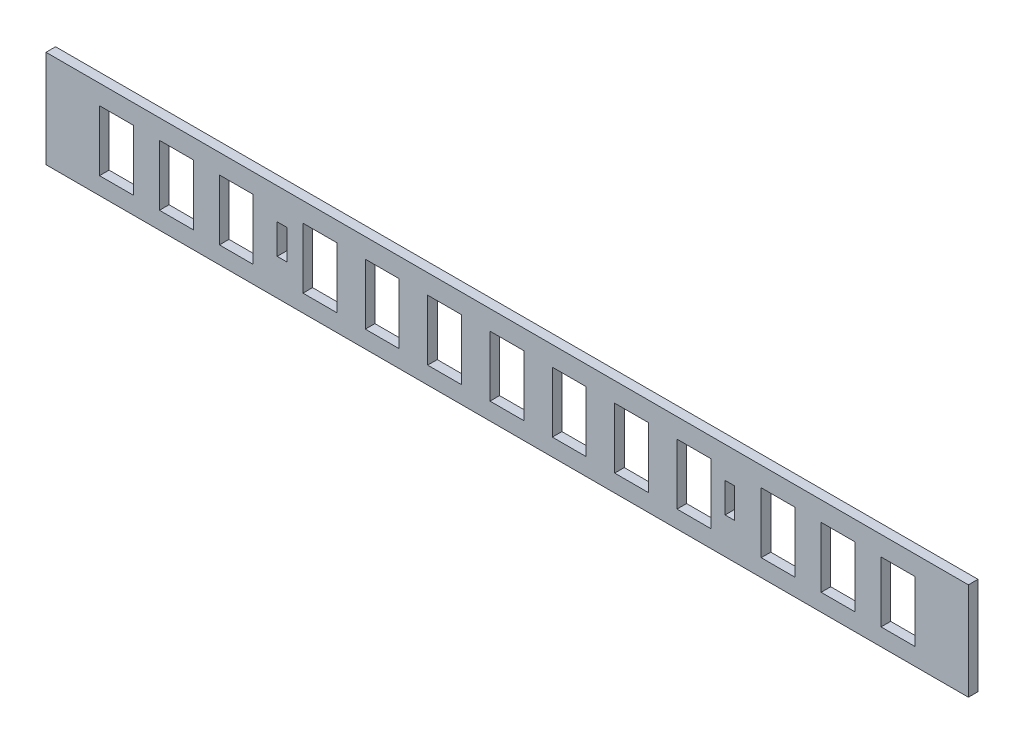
ISO-10303-21;
HEADER;
FILE_DESCRIPTION(('STEP AP214'),'2;1');
FILE_NAME('part.step','',(''),(''),'','','');
FILE_SCHEMA(('AUTOMOTIVE_DESIGN { 1 0 10303 214 1 1 1 1 }'));
ENDSEC;
DATA;
#1=APPLICATION_CONTEXT('core data for automotive mechanical design processes');
#2=APPLICATION_PROTOCOL_DEFINITION('international standard','automotive_design',2000,#1);
#3=PRODUCT_CONTEXT('',#1,'mechanical');
#4=PRODUCT('Part','Part','',(#3));
#5=PRODUCT_RELATED_PRODUCT_CATEGORY('part','',(#4));
#6=PRODUCT_DEFINITION_FORMATION('','',#4);
#7=PRODUCT_DEFINITION_CONTEXT('part definition',#1,'design');
#8=PRODUCT_DEFINITION('design','',#6,#7);
#9=PRODUCT_DEFINITION_SHAPE('','',#8);
#10=(LENGTH_UNIT() NAMED_UNIT(*) SI_UNIT(.MILLI.,.METRE.));
#11=(NAMED_UNIT(*) PLANE_ANGLE_UNIT() SI_UNIT($,.RADIAN.));
#12=(NAMED_UNIT(*) SI_UNIT($,.STERADIAN.) SOLID_ANGLE_UNIT());
#13=UNCERTAINTY_MEASURE_WITH_UNIT(LENGTH_MEASURE(1.E-05),#10,'distance_accuracy_value','');
#14=(GEOMETRIC_REPRESENTATION_CONTEXT(3) GLOBAL_UNCERTAINTY_ASSIGNED_CONTEXT((#13)) GLOBAL_UNIT_ASSIGNED_CONTEXT((#10,
#11,#12)) REPRESENTATION_CONTEXT('',''));
#15=CARTESIAN_POINT('',(0.,0.,0.));
#16=DIRECTION('',(0.,0.,1.));
#17=DIRECTION('',(1.,0.,0.));
#18=AXIS2_PLACEMENT_3D('',#15,#16,#17);
#19=CARTESIAN_POINT('',(0.,0.,1.524));
#20=DIRECTION('',(0.,0.,1.));
#21=DIRECTION('',(1.,0.,0.));
#22=AXIS2_PLACEMENT_3D('',#19,#20,#21);
#23=PLANE('',#22);
#24=DIRECTION('',(0.,1.,0.));
#25=VECTOR('',#24,1.);
#26=CARTESIAN_POINT('',(91.8091556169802,151.540150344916,1.524));
#27=LINE('',#26,#25);
#28=CARTESIAN_POINT('',(91.8091556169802,151.540150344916,1.524));
#29=VERTEX_POINT('',#28);
#30=CARTESIAN_POINT('',(91.8091556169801,161.167073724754,1.524));
#31=VERTEX_POINT('',#30);
#32=EDGE_CURVE('E475',#29,#31,#27,.T.);
#33=ORIENTED_EDGE('',*,*,#32,.F.);
#34=DIRECTION('',(1.,0.,0.));
#35=VECTOR('',#34,1.);
#36=CARTESIAN_POINT('',(91.8091556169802,151.540150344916,1.524));
#37=LINE('',#36,#35);
#38=CARTESIAN_POINT('',(86.43753361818,151.540150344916,1.524));
#39=VERTEX_POINT('',#38);
#40=EDGE_CURVE('E473',#39,#29,#37,.T.);
#41=ORIENTED_EDGE('',*,*,#40,.F.);
#42=DIRECTION('',(0.,-1.,0.));
#43=VECTOR('',#42,1.);
#44=CARTESIAN_POINT('',(86.43753361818,151.540150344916,1.524));
#45=LINE('',#44,#43);
#46=CARTESIAN_POINT('',(86.4375336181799,161.167073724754,1.524));
#47=VERTEX_POINT('',#46);
#48=EDGE_CURVE('E481',#47,#39,#45,.T.);
#49=ORIENTED_EDGE('',*,*,#48,.F.);
#50=DIRECTION('',(-1.,0.,0.));
#51=VECTOR('',#50,1.);
#52=CARTESIAN_POINT('',(91.8091556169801,161.167073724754,1.524));
#53=LINE('',#52,#51);
#54=EDGE_CURVE('E478',#31,#47,#53,.T.);
#55=ORIENTED_EDGE('',*,*,#54,.F.);
#56=EDGE_LOOP('',(#33,#41,#49,#55));
#57=FACE_BOUND('',#56,.T.);
#58=DIRECTION('',(1.,0.,0.));
#59=VECTOR('',#58,1.);
#60=CARTESIAN_POINT('',(53.6316112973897,151.540150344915,1.524));
#61=LINE('',#60,#59);
#62=CARTESIAN_POINT('',(53.6316112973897,151.540150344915,1.524));
#63=VERTEX_POINT('',#62);
#64=CARTESIAN_POINT('',(59.0032332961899,151.540150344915,1.524));
#65=VERTEX_POINT('',#64);
#66=EDGE_CURVE('E537',#63,#65,#61,.T.);
#67=ORIENTED_EDGE('',*,*,#66,.F.);
#68=DIRECTION('',(0.,-1.,0.));
#69=VECTOR('',#68,1.);
#70=CARTESIAN_POINT('',(53.6316112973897,151.540150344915,1.524));
#71=LINE('',#70,#69);
#72=CARTESIAN_POINT('',(53.6316112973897,161.167073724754,1.524));
#73=VERTEX_POINT('',#72);
#74=EDGE_CURVE('E535',#73,#63,#71,.T.);
#75=ORIENTED_EDGE('',*,*,#74,.F.);
#76=DIRECTION('',(-1.,0.,0.));
#77=VECTOR('',#76,1.);
#78=CARTESIAN_POINT('',(53.6316112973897,161.167073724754,1.524));
#79=LINE('',#78,#77);
#80=CARTESIAN_POINT('',(59.0032332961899,161.167073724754,1.524));
#81=VERTEX_POINT('',#80);
#82=EDGE_CURVE('E543',#81,#73,#79,.T.);
#83=ORIENTED_EDGE('',*,*,#82,.F.);
#84=DIRECTION('',(0.,1.,0.));
#85=VECTOR('',#84,1.);
#86=CARTESIAN_POINT('',(59.0032332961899,151.540150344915,1.524));
#87=LINE('',#86,#85);
#88=EDGE_CURVE('E540',#65,#81,#87,.T.);
#89=ORIENTED_EDGE('',*,*,#88,.F.);
#90=EDGE_LOOP('',(#67,#75,#83,#89));
#91=FACE_BOUND('',#90,.T.);
#92=DIRECTION('',(1.,0.,0.));
#93=VECTOR('',#92,1.);
#94=CARTESIAN_POINT('',(33.8196112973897,151.540150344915,1.524));
#95=LINE('',#94,#93);
#96=CARTESIAN_POINT('',(33.8196112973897,151.540150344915,1.524));
#97=VERTEX_POINT('',#96);
#98=CARTESIAN_POINT('',(39.1912332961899,151.540150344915,1.524));
#99=VERTEX_POINT('',#98);
#100=EDGE_CURVE('E599',#97,#99,#95,.T.);
#101=ORIENTED_EDGE('',*,*,#100,.F.);
#102=DIRECTION('',(0.,-1.,0.));
#103=VECTOR('',#102,1.);
#104=CARTESIAN_POINT('',(33.8196112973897,151.540150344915,1.524));
#105=LINE('',#104,#103);
#106=CARTESIAN_POINT('',(33.8196112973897,161.167073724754,1.524));
#107=VERTEX_POINT('',#106);
#108=EDGE_CURVE('E597',#107,#97,#105,.T.);
#109=ORIENTED_EDGE('',*,*,#108,.F.);
#110=DIRECTION('',(-1.,0.,0.));
#111=VECTOR('',#110,1.);
#112=CARTESIAN_POINT('',(33.8196112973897,161.167073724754,1.524));
#113=LINE('',#112,#111);
#114=CARTESIAN_POINT('',(39.1912332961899,161.167073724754,1.524));
#115=VERTEX_POINT('',#114);
#116=EDGE_CURVE('E605',#115,#107,#113,.T.);
#117=ORIENTED_EDGE('',*,*,#116,.F.);
#118=DIRECTION('',(0.,1.,0.));
#119=VECTOR('',#118,1.);
#120=CARTESIAN_POINT('',(39.1912332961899,151.540150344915,1.524));
#121=LINE('',#120,#119);
#122=EDGE_CURVE('E602',#99,#115,#121,.T.);
#123=ORIENTED_EDGE('',*,*,#122,.F.);
#124=EDGE_LOOP('',(#101,#109,#117,#123));
#125=FACE_BOUND('',#124,.T.);
#126=DIRECTION('',(1.,0.,0.));
#127=VECTOR('',#126,1.);
#128=CARTESIAN_POINT('',(14.0076112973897,151.540150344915,1.524));
#129=LINE('',#128,#127);
#130=CARTESIAN_POINT('',(14.0076112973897,151.540150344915,1.524));
#131=VERTEX_POINT('',#130);
#132=CARTESIAN_POINT('',(19.3792332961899,151.540150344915,1.524));
#133=VERTEX_POINT('',#132);
#134=EDGE_CURVE('E661',#131,#133,#129,.T.);
#135=ORIENTED_EDGE('',*,*,#134,.F.);
#136=DIRECTION('',(0.,-1.,0.));
#137=VECTOR('',#136,1.);
#138=CARTESIAN_POINT('',(14.0076112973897,151.540150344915,1.524));
#139=LINE('',#138,#137);
#140=CARTESIAN_POINT('',(14.0076112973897,161.167073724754,1.524));
#141=VERTEX_POINT('',#140);
#142=EDGE_CURVE('E659',#141,#131,#139,.T.);
#143=ORIENTED_EDGE('',*,*,#142,.F.);
#144=DIRECTION('',(-1.,0.,0.));
#145=VECTOR('',#144,1.);
#146=CARTESIAN_POINT('',(14.0076112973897,161.167073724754,1.524));
#147=LINE('',#146,#145);
#148=CARTESIAN_POINT('',(19.3792332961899,161.167073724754,1.524));
#149=VERTEX_POINT('',#148);
#150=EDGE_CURVE('E667',#149,#141,#147,.T.);
#151=ORIENTED_EDGE('',*,*,#150,.F.);
#152=DIRECTION('',(0.,1.,0.));
#153=VECTOR('',#152,1.);
#154=CARTESIAN_POINT('',(19.3792332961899,151.540150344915,1.524));
#155=LINE('',#154,#153);
#156=EDGE_CURVE('E664',#133,#149,#155,.T.);
#157=ORIENTED_EDGE('',*,*,#156,.F.);
#158=EDGE_LOOP('',(#135,#143,#151,#157));
#159=FACE_BOUND('',#158,.T.);
#160=DIRECTION('',(1.,0.,0.));
#161=VECTOR('',#160,1.);
#162=CARTESIAN_POINT('',(-9.18068339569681,151.540150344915,1.524));
#163=LINE('',#162,#161);
#164=CARTESIAN_POINT('',(-9.18068339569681,151.540150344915,1.524));
#165=VERTEX_POINT('',#164);
#166=CARTESIAN_POINT('',(-3.80906139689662,151.540150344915,1.524));
#167=VERTEX_POINT('',#166);
#168=EDGE_CURVE('E723',#165,#167,#163,.T.);
#169=ORIENTED_EDGE('',*,*,#168,.F.);
#170=DIRECTION('',(0.,-1.,0.));
#171=VECTOR('',#170,1.);
#172=CARTESIAN_POINT('',(-9.18068339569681,151.540150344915,1.524));
#173=LINE('',#172,#171);
#174=CARTESIAN_POINT('',(-9.18068339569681,161.167073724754,1.524));
#175=VERTEX_POINT('',#174);
#176=EDGE_CURVE('E721',#175,#165,#173,.T.);
#177=ORIENTED_EDGE('',*,*,#176,.F.);
#178=DIRECTION('',(-1.,0.,0.));
#179=VECTOR('',#178,1.);
#180=CARTESIAN_POINT('',(-9.18068339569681,161.167073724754,1.524));
#181=LINE('',#180,#179);
#182=CARTESIAN_POINT('',(-3.80906139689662,161.167073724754,1.524));
#183=VERTEX_POINT('',#182);
#184=EDGE_CURVE('E729',#183,#175,#181,.T.);
#185=ORIENTED_EDGE('',*,*,#184,.F.);
#186=DIRECTION('',(0.,1.,0.));
#187=VECTOR('',#186,1.);
#188=CARTESIAN_POINT('',(-3.80906139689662,151.540150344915,1.524));
#189=LINE('',#188,#187);
#190=EDGE_CURVE('E726',#167,#183,#189,.T.);
#191=ORIENTED_EDGE('',*,*,#190,.F.);
#192=EDGE_LOOP('',(#169,#177,#185,#191));
#193=FACE_BOUND('',#192,.T.);
#194=DIRECTION('',(0.,1.,0.));
#195=VECTOR('',#194,1.);
#196=CARTESIAN_POINT('',(82.2841556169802,151.540150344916,1.524));
#197=LINE('',#196,#195);
#198=CARTESIAN_POINT('',(82.2841556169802,151.540150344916,1.524));
#199=VERTEX_POINT('',#198);
#200=CARTESIAN_POINT('',(82.2841556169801,161.167073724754,1.524));
#201=VERTEX_POINT('',#200);
#202=EDGE_CURVE('E785',#199,#201,#197,.T.);
#203=ORIENTED_EDGE('',*,*,#202,.F.);
#204=DIRECTION('',(1.,0.,0.));
#205=VECTOR('',#204,1.);
#206=CARTESIAN_POINT('',(82.2841556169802,151.540150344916,1.524));
#207=LINE('',#206,#205);
#208=CARTESIAN_POINT('',(76.91253361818,151.540150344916,1.524));
#209=VERTEX_POINT('',#208);
#210=EDGE_CURVE('E783',#209,#199,#207,.T.);
#211=ORIENTED_EDGE('',*,*,#210,.F.);
#212=DIRECTION('',(0.,-1.,0.));
#213=VECTOR('',#212,1.);
#214=CARTESIAN_POINT('',(76.91253361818,151.540150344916,1.524));
#215=LINE('',#214,#213);
#216=CARTESIAN_POINT('',(76.9125336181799,161.167073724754,1.524));
#217=VERTEX_POINT('',#216);
#218=EDGE_CURVE('E791',#217,#209,#215,.T.);
#219=ORIENTED_EDGE('',*,*,#218,.F.);
#220=DIRECTION('',(-1.,0.,0.));
#221=VECTOR('',#220,1.);
#222=CARTESIAN_POINT('',(82.2841556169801,161.167073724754,1.524));
#223=LINE('',#222,#221);
#224=EDGE_CURVE('E788',#201,#217,#223,.T.);
#225=ORIENTED_EDGE('',*,*,#224,.F.);
#226=EDGE_LOOP('',(#203,#211,#219,#225));
#227=FACE_BOUND('',#226,.T.);
#228=DIRECTION('',(1.,0.,0.));
#229=VECTOR('',#228,1.);
#230=CARTESIAN_POINT('',(-28.2306833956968,151.540150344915,1.524));
#231=LINE('',#230,#229);
#232=CARTESIAN_POINT('',(-28.2306833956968,151.540150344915,1.524));
#233=VERTEX_POINT('',#232);
#234=CARTESIAN_POINT('',(-22.8590613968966,151.540150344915,1.524));
#235=VERTEX_POINT('',#234);
#236=EDGE_CURVE('E847',#233,#235,#231,.T.);
#237=ORIENTED_EDGE('',*,*,#236,.F.);
#238=DIRECTION('',(0.,-1.,0.));
#239=VECTOR('',#238,1.);
#240=CARTESIAN_POINT('',(-28.2306833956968,151.540150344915,1.524));
#241=LINE('',#240,#239);
#242=CARTESIAN_POINT('',(-28.2306833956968,161.167073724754,1.524));
#243=VERTEX_POINT('',#242);
#244=EDGE_CURVE('E845',#243,#233,#241,.T.);
#245=ORIENTED_EDGE('',*,*,#244,.F.);
#246=DIRECTION('',(-1.,0.,0.));
#247=VECTOR('',#246,1.);
#248=CARTESIAN_POINT('',(-28.2306833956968,161.167073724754,1.524));
#249=LINE('',#248,#247);
#250=CARTESIAN_POINT('',(-22.8590613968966,161.167073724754,1.524));
#251=VERTEX_POINT('',#250);
#252=EDGE_CURVE('E853',#251,#243,#249,.T.);
#253=ORIENTED_EDGE('',*,*,#252,.F.);
#254=DIRECTION('',(0.,1.,0.));
#255=VECTOR('',#254,1.);
#256=CARTESIAN_POINT('',(-22.8590613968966,151.540150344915,1.524));
#257=LINE('',#256,#255);
#258=EDGE_CURVE('E850',#235,#251,#257,.T.);
#259=ORIENTED_EDGE('',*,*,#258,.F.);
#260=EDGE_LOOP('',(#237,#245,#253,#259));
#261=FACE_BOUND('',#260,.T.);
#262=DIRECTION('',(0.,1.,0.));
#263=VECTOR('',#262,1.);
#264=CARTESIAN_POINT('',(109.839425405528,148.79640556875,1.524));
#265=LINE('',#264,#263);
#266=CARTESIAN_POINT('',(109.839425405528,148.79640556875,1.524));
#267=VERTEX_POINT('',#266);
#268=CARTESIAN_POINT('',(109.839425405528,164.270160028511,1.524));
#269=VERTEX_POINT('',#268);
#270=EDGE_CURVE('E907',#267,#269,#265,.T.);
#271=ORIENTED_EDGE('',*,*,#270,.T.);
#272=DIRECTION('',(-1.,0.,0.));
#273=VECTOR('',#272,1.);
#274=CARTESIAN_POINT('',(109.839425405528,164.270160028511,1.524));
#275=LINE('',#274,#273);
#276=CARTESIAN_POINT('',(-36.7359531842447,164.270160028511,1.524));
#277=VERTEX_POINT('',#276);
#278=EDGE_CURVE('E910',#269,#277,#275,.T.);
#279=ORIENTED_EDGE('',*,*,#278,.T.);
#280=DIRECTION('',(0.,-1.,0.));
#281=VECTOR('',#280,1.);
#282=CARTESIAN_POINT('',(-36.7359531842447,148.79640556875,1.524));
#283=LINE('',#282,#281);
#284=CARTESIAN_POINT('',(-36.7359531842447,148.79640556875,1.524));
#285=VERTEX_POINT('',#284);
#286=EDGE_CURVE('E913',#277,#285,#283,.T.);
#287=ORIENTED_EDGE('',*,*,#286,.T.);
#288=DIRECTION('',(1.,0.,0.));
#289=VECTOR('',#288,1.);
#290=CARTESIAN_POINT('',(109.839425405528,148.79640556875,1.524));
#291=LINE('',#290,#289);
#292=EDGE_CURVE('E915',#285,#267,#291,.T.);
#293=ORIENTED_EDGE('',*,*,#292,.T.);
#294=EDGE_LOOP('',(#271,#279,#287,#293));
#295=FACE_BOUND('',#294,.T.);
#296=DIRECTION('',(1.,0.,0.));
#297=VECTOR('',#296,1.);
#298=CARTESIAN_POINT('',(0.,154.54949113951,1.524));
#299=LINE('',#298,#297);
#300=CARTESIAN_POINT('',(0.,154.54949113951,1.524));
#301=VERTEX_POINT('',#300);
#302=CARTESIAN_POINT('',(1.524,154.54949113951,1.524));
#303=VERTEX_POINT('',#302);
#304=EDGE_CURVE('E878',#301,#303,#299,.T.);
#305=ORIENTED_EDGE('',*,*,#304,.F.);
#306=DIRECTION('',(0.,-1.,0.));
#307=VECTOR('',#306,1.);
#308=CARTESIAN_POINT('',(0.,159.31199113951,1.524));
#309=LINE('',#308,#307);
#310=CARTESIAN_POINT('',(0.,159.31199113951,1.524));
#311=VERTEX_POINT('',#310);
#312=EDGE_CURVE('E876',#311,#301,#309,.T.);
#313=ORIENTED_EDGE('',*,*,#312,.F.);
#314=DIRECTION('',(-1.,0.,0.));
#315=VECTOR('',#314,1.);
#316=CARTESIAN_POINT('',(0.,159.31199113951,1.524));
#317=LINE('',#316,#315);
#318=CARTESIAN_POINT('',(1.524,159.31199113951,1.524));
#319=VERTEX_POINT('',#318);
#320=EDGE_CURVE('E884',#319,#311,#317,.T.);
#321=ORIENTED_EDGE('',*,*,#320,.F.);
#322=DIRECTION('',(0.,1.,0.));
#323=VECTOR('',#322,1.);
#324=CARTESIAN_POINT('',(1.524,159.31199113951,1.524));
#325=LINE('',#324,#323);
#326=EDGE_CURVE('E881',#303,#319,#325,.T.);
#327=ORIENTED_EDGE('',*,*,#326,.F.);
#328=EDGE_LOOP('',(#305,#313,#321,#327));
#329=FACE_BOUND('',#328,.T.);
#330=DIRECTION('',(1.,0.,0.));
#331=VECTOR('',#330,1.);
#332=CARTESIAN_POINT('',(71.1696072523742,154.54949113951,1.524));
#333=LINE('',#332,#331);
#334=CARTESIAN_POINT('',(71.1696072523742,154.54949113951,1.524));
#335=VERTEX_POINT('',#334);
#336=CARTESIAN_POINT('',(72.6936072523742,154.54949113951,1.524));
#337=VERTEX_POINT('',#336);
#338=EDGE_CURVE('E816',#335,#337,#333,.T.);
#339=ORIENTED_EDGE('',*,*,#338,.F.);
#340=DIRECTION('',(0.,-1.,0.));
#341=VECTOR('',#340,1.);
#342=CARTESIAN_POINT('',(71.1696072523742,154.54949113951,1.524));
#343=LINE('',#342,#341);
#344=CARTESIAN_POINT('',(71.1696072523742,159.31199113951,1.524));
#345=VERTEX_POINT('',#344);
#346=EDGE_CURVE('E814',#345,#335,#343,.T.);
#347=ORIENTED_EDGE('',*,*,#346,.F.);
#348=DIRECTION('',(-1.,0.,0.));
#349=VECTOR('',#348,1.);
#350=CARTESIAN_POINT('',(71.1696072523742,159.31199113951,1.524));
#351=LINE('',#350,#349);
#352=CARTESIAN_POINT('',(72.6936072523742,159.31199113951,1.524));
#353=VERTEX_POINT('',#352);
#354=EDGE_CURVE('E822',#353,#345,#351,.T.);
#355=ORIENTED_EDGE('',*,*,#354,.F.);
#356=DIRECTION('',(0.,1.,0.));
#357=VECTOR('',#356,1.);
#358=CARTESIAN_POINT('',(72.6936072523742,154.54949113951,1.524));
#359=LINE('',#358,#357);
#360=EDGE_CURVE('E819',#337,#353,#359,.T.);
#361=ORIENTED_EDGE('',*,*,#360,.F.);
#362=EDGE_LOOP('',(#339,#347,#355,#361));
#363=FACE_BOUND('',#362,.T.);
#364=DIRECTION('',(1.,0.,0.));
#365=VECTOR('',#364,1.);
#366=CARTESIAN_POINT('',(-18.7056833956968,151.540150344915,1.524));
#367=LINE('',#366,#365);
#368=CARTESIAN_POINT('',(-18.7056833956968,151.540150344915,1.524));
#369=VERTEX_POINT('',#368);
#370=CARTESIAN_POINT('',(-13.3340613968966,151.540150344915,1.524));
#371=VERTEX_POINT('',#370);
#372=EDGE_CURVE('E754',#369,#371,#367,.T.);
#373=ORIENTED_EDGE('',*,*,#372,.F.);
#374=DIRECTION('',(0.,-1.,0.));
#375=VECTOR('',#374,1.);
#376=CARTESIAN_POINT('',(-18.7056833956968,151.540150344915,1.524));
#377=LINE('',#376,#375);
#378=CARTESIAN_POINT('',(-18.7056833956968,161.167073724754,1.524));
#379=VERTEX_POINT('',#378);
#380=EDGE_CURVE('E752',#379,#369,#377,.T.);
#381=ORIENTED_EDGE('',*,*,#380,.F.);
#382=DIRECTION('',(-1.,0.,0.));
#383=VECTOR('',#382,1.);
#384=CARTESIAN_POINT('',(-18.7056833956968,161.167073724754,1.524));
#385=LINE('',#384,#383);
#386=CARTESIAN_POINT('',(-13.3340613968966,161.167073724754,1.524));
#387=VERTEX_POINT('',#386);
#388=EDGE_CURVE('E760',#387,#379,#385,.T.);
#389=ORIENTED_EDGE('',*,*,#388,.F.);
#390=DIRECTION('',(0.,1.,0.));
#391=VECTOR('',#390,1.);
#392=CARTESIAN_POINT('',(-13.3340613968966,151.540150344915,1.524));
#393=LINE('',#392,#391);
#394=EDGE_CURVE('E757',#371,#387,#393,.T.);
#395=ORIENTED_EDGE('',*,*,#394,.F.);
#396=EDGE_LOOP('',(#373,#381,#389,#395));
#397=FACE_BOUND('',#396,.T.);
#398=DIRECTION('',(1.,0.,0.));
#399=VECTOR('',#398,1.);
#400=CARTESIAN_POINT('',(4.10161129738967,151.540150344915,1.524));
#401=LINE('',#400,#399);
#402=CARTESIAN_POINT('',(4.10161129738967,151.540150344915,1.524));
#403=VERTEX_POINT('',#402);
#404=CARTESIAN_POINT('',(9.47323329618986,151.540150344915,1.524));
#405=VERTEX_POINT('',#404);
#406=EDGE_CURVE('E692',#403,#405,#401,.T.);
#407=ORIENTED_EDGE('',*,*,#406,.F.);
#408=DIRECTION('',(0.,-1.,0.));
#409=VECTOR('',#408,1.);
#410=CARTESIAN_POINT('',(4.10161129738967,151.540150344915,1.524));
#411=LINE('',#410,#409);
#412=CARTESIAN_POINT('',(4.10161129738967,161.167073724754,1.524));
#413=VERTEX_POINT('',#412);
#414=EDGE_CURVE('E690',#413,#403,#411,.T.);
#415=ORIENTED_EDGE('',*,*,#414,.F.);
#416=DIRECTION('',(-1.,0.,0.));
#417=VECTOR('',#416,1.);
#418=CARTESIAN_POINT('',(4.10161129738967,161.167073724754,1.524));
#419=LINE('',#418,#417);
#420=CARTESIAN_POINT('',(9.47323329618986,161.167073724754,1.524));
#421=VERTEX_POINT('',#420);
#422=EDGE_CURVE('E698',#421,#413,#419,.T.);
#423=ORIENTED_EDGE('',*,*,#422,.F.);
#424=DIRECTION('',(0.,1.,0.));
#425=VECTOR('',#424,1.);
#426=CARTESIAN_POINT('',(9.47323329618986,151.540150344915,1.524));
#427=LINE('',#426,#425);
#428=EDGE_CURVE('E695',#405,#421,#427,.T.);
#429=ORIENTED_EDGE('',*,*,#428,.F.);
#430=EDGE_LOOP('',(#407,#415,#423,#429));
#431=FACE_BOUND('',#430,.T.);
#432=DIRECTION('',(1.,0.,0.));
#433=VECTOR('',#432,1.);
#434=CARTESIAN_POINT('',(23.9136112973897,151.540150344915,1.524));
#435=LINE('',#434,#433);
#436=CARTESIAN_POINT('',(23.9136112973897,151.540150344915,1.524));
#437=VERTEX_POINT('',#436);
#438=CARTESIAN_POINT('',(29.2852332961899,151.540150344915,1.524));
#439=VERTEX_POINT('',#438);
#440=EDGE_CURVE('E630',#437,#439,#435,.T.);
#441=ORIENTED_EDGE('',*,*,#440,.F.);
#442=DIRECTION('',(0.,-1.,0.));
#443=VECTOR('',#442,1.);
#444=CARTESIAN_POINT('',(23.9136112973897,151.540150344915,1.524));
#445=LINE('',#444,#443);
#446=CARTESIAN_POINT('',(23.9136112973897,161.167073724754,1.524));
#447=VERTEX_POINT('',#446);
#448=EDGE_CURVE('E628',#447,#437,#445,.T.);
#449=ORIENTED_EDGE('',*,*,#448,.F.);
#450=DIRECTION('',(-1.,0.,0.));
#451=VECTOR('',#450,1.);
#452=CARTESIAN_POINT('',(23.9136112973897,161.167073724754,1.524));
#453=LINE('',#452,#451);
#454=CARTESIAN_POINT('',(29.2852332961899,161.167073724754,1.524));
#455=VERTEX_POINT('',#454);
#456=EDGE_CURVE('E636',#455,#447,#453,.T.);
#457=ORIENTED_EDGE('',*,*,#456,.F.);
#458=DIRECTION('',(0.,1.,0.));
#459=VECTOR('',#458,1.);
#460=CARTESIAN_POINT('',(29.2852332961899,151.540150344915,1.524));
#461=LINE('',#460,#459);
#462=EDGE_CURVE('E633',#439,#455,#461,.T.);
#463=ORIENTED_EDGE('',*,*,#462,.F.);
#464=EDGE_LOOP('',(#441,#449,#457,#463));
#465=FACE_BOUND('',#464,.T.);
#466=DIRECTION('',(1.,0.,0.));
#467=VECTOR('',#466,1.);
#468=CARTESIAN_POINT('',(43.7256112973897,151.540150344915,1.524));
#469=LINE('',#468,#467);
#470=CARTESIAN_POINT('',(43.7256112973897,151.540150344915,1.524));
#471=VERTEX_POINT('',#470);
#472=CARTESIAN_POINT('',(49.0972332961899,151.540150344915,1.524));
#473=VERTEX_POINT('',#472);
#474=EDGE_CURVE('E568',#471,#473,#469,.T.);
#475=ORIENTED_EDGE('',*,*,#474,.F.);
#476=DIRECTION('',(0.,-1.,0.));
#477=VECTOR('',#476,1.);
#478=CARTESIAN_POINT('',(43.7256112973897,151.540150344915,1.524));
#479=LINE('',#478,#477);
#480=CARTESIAN_POINT('',(43.7256112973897,161.167073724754,1.524));
#481=VERTEX_POINT('',#480);
#482=EDGE_CURVE('E566',#481,#471,#479,.T.);
#483=ORIENTED_EDGE('',*,*,#482,.F.);
#484=DIRECTION('',(-1.,0.,0.));
#485=VECTOR('',#484,1.);
#486=CARTESIAN_POINT('',(43.7256112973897,161.167073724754,1.524));
#487=LINE('',#486,#485);
#488=CARTESIAN_POINT('',(49.0972332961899,161.167073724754,1.524));
#489=VERTEX_POINT('',#488);
#490=EDGE_CURVE('E574',#489,#481,#487,.T.);
#491=ORIENTED_EDGE('',*,*,#490,.F.);
#492=DIRECTION('',(0.,1.,0.));
#493=VECTOR('',#492,1.);
#494=CARTESIAN_POINT('',(49.0972332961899,151.540150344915,1.524));
#495=LINE('',#494,#493);
#496=EDGE_CURVE('E571',#473,#489,#495,.T.);
#497=ORIENTED_EDGE('',*,*,#496,.F.);
#498=EDGE_LOOP('',(#475,#483,#491,#497));
#499=FACE_BOUND('',#498,.T.);
#500=DIRECTION('',(1.,0.,0.));
#501=VECTOR('',#500,1.);
#502=CARTESIAN_POINT('',(63.5376112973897,151.540150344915,1.524));
#503=LINE('',#502,#501);
#504=CARTESIAN_POINT('',(63.5376112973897,151.540150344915,1.524));
#505=VERTEX_POINT('',#504);
#506=CARTESIAN_POINT('',(68.9092332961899,151.540150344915,1.524));
#507=VERTEX_POINT('',#506);
#508=EDGE_CURVE('E506',#505,#507,#503,.T.);
#509=ORIENTED_EDGE('',*,*,#508,.F.);
#510=DIRECTION('',(0.,-1.,0.));
#511=VECTOR('',#510,1.);
#512=CARTESIAN_POINT('',(63.5376112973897,151.540150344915,1.524));
#513=LINE('',#512,#511);
#514=CARTESIAN_POINT('',(63.5376112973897,161.167073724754,1.524));
#515=VERTEX_POINT('',#514);
#516=EDGE_CURVE('E504',#515,#505,#513,.T.);
#517=ORIENTED_EDGE('',*,*,#516,.F.);
#518=DIRECTION('',(-1.,0.,0.));
#519=VECTOR('',#518,1.);
#520=CARTESIAN_POINT('',(63.5376112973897,161.167073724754,1.524));
#521=LINE('',#520,#519);
#522=CARTESIAN_POINT('',(68.9092332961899,161.167073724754,1.524));
#523=VERTEX_POINT('',#522);
#524=EDGE_CURVE('E512',#523,#515,#521,.T.);
#525=ORIENTED_EDGE('',*,*,#524,.F.);
#526=DIRECTION('',(0.,1.,0.));
#527=VECTOR('',#526,1.);
#528=CARTESIAN_POINT('',(68.9092332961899,151.540150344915,1.524));
#529=LINE('',#528,#527);
#530=EDGE_CURVE('E509',#507,#523,#529,.T.);
#531=ORIENTED_EDGE('',*,*,#530,.F.);
#532=EDGE_LOOP('',(#509,#517,#525,#531));
#533=FACE_BOUND('',#532,.T.);
#534=DIRECTION('',(0.,1.,0.));
#535=VECTOR('',#534,1.);
#536=CARTESIAN_POINT('',(101.33415561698,151.540150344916,1.524));
#537=LINE('',#536,#535);
#538=CARTESIAN_POINT('',(101.33415561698,151.540150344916,1.524));
#539=VERTEX_POINT('',#538);
#540=CARTESIAN_POINT('',(101.33415561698,161.167073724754,1.524));
#541=VERTEX_POINT('',#540);
#542=EDGE_CURVE('E445',#539,#541,#537,.T.);
#543=ORIENTED_EDGE('',*,*,#542,.F.);
#544=DIRECTION('',(1.,0.,0.));
#545=VECTOR('',#544,1.);
#546=CARTESIAN_POINT('',(101.33415561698,151.540150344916,1.524));
#547=LINE('',#546,#545);
#548=CARTESIAN_POINT('',(95.96253361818,151.540150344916,1.524));
#549=VERTEX_POINT('',#548);
#550=EDGE_CURVE('E437',#549,#539,#547,.T.);
#551=ORIENTED_EDGE('',*,*,#550,.F.);
#552=DIRECTION('',(0.,-1.,0.));
#553=VECTOR('',#552,1.);
#554=CARTESIAN_POINT('',(95.96253361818,151.540150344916,1.524));
#555=LINE('',#554,#553);
#556=CARTESIAN_POINT('',(95.9625336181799,161.167073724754,1.524));
#557=VERTEX_POINT('',#556);
#558=EDGE_CURVE('E459',#557,#549,#555,.T.);
#559=ORIENTED_EDGE('',*,*,#558,.F.);
#560=DIRECTION('',(-1.,0.,0.));
#561=VECTOR('',#560,1.);
#562=CARTESIAN_POINT('',(101.33415561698,161.167073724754,1.524));
#563=LINE('',#562,#561);
#564=EDGE_CURVE('E457',#541,#557,#563,.T.);
#565=ORIENTED_EDGE('',*,*,#564,.F.);
#566=EDGE_LOOP('',(#543,#551,#559,#565));
#567=FACE_BOUND('',#566,.T.);
#568=ADVANCED_FACE('F36',(#57,#91,#125,#159,#193,#227,#261,#295,#329,#363,#397,#431,#465,#499,
#533,#567),#23,.T.);
#569=CARTESIAN_POINT('',(0.,0.,0.));
#570=DIRECTION('',(0.,0.,1.));
#571=DIRECTION('',(1.,0.,0.));
#572=AXIS2_PLACEMENT_3D('',#569,#570,#571);
#573=PLANE('',#572);
#574=DIRECTION('',(1.,0.,0.));
#575=VECTOR('',#574,1.);
#576=CARTESIAN_POINT('',(91.8091556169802,151.540150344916,0.));
#577=LINE('',#576,#575);
#578=CARTESIAN_POINT('',(86.43753361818,151.540150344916,0.));
#579=VERTEX_POINT('',#578);
#580=CARTESIAN_POINT('',(91.8091556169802,151.540150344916,0.));
#581=VERTEX_POINT('',#580);
#582=EDGE_CURVE('E453',#579,#581,#577,.T.);
#583=ORIENTED_EDGE('',*,*,#582,.T.);
#584=DIRECTION('',(0.,1.,0.));
#585=VECTOR('',#584,1.);
#586=CARTESIAN_POINT('',(91.8091556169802,151.540150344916,0.));
#587=LINE('',#586,#585);
#588=CARTESIAN_POINT('',(91.8091556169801,161.167073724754,0.));
#589=VERTEX_POINT('',#588);
#590=EDGE_CURVE('E486',#581,#589,#587,.T.);
#591=ORIENTED_EDGE('',*,*,#590,.T.);
#592=DIRECTION('',(-1.,0.,0.));
#593=VECTOR('',#592,1.);
#594=CARTESIAN_POINT('',(91.8091556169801,161.167073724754,0.));
#595=LINE('',#594,#593);
#596=CARTESIAN_POINT('',(86.4375336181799,161.167073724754,0.));
#597=VERTEX_POINT('',#596);
#598=EDGE_CURVE('E489',#589,#597,#595,.T.);
#599=ORIENTED_EDGE('',*,*,#598,.T.);
#600=DIRECTION('',(0.,-1.,0.));
#601=VECTOR('',#600,1.);
#602=CARTESIAN_POINT('',(86.43753361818,151.540150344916,0.));
#603=LINE('',#602,#601);
#604=EDGE_CURVE('E476',#597,#579,#603,.T.);
#605=ORIENTED_EDGE('',*,*,#604,.T.);
#606=EDGE_LOOP('',(#583,#591,#599,#605));
#607=FACE_BOUND('',#606,.T.);
#608=DIRECTION('',(0.,-1.,0.));
#609=VECTOR('',#608,1.);
#610=CARTESIAN_POINT('',(53.6316112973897,151.540150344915,0.));
#611=LINE('',#610,#609);
#612=CARTESIAN_POINT('',(53.6316112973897,161.167073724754,0.));
#613=VERTEX_POINT('',#612);
#614=CARTESIAN_POINT('',(53.6316112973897,151.540150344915,0.));
#615=VERTEX_POINT('',#614);
#616=EDGE_CURVE('E534',#613,#615,#611,.T.);
#617=ORIENTED_EDGE('',*,*,#616,.T.);
#618=DIRECTION('',(1.,0.,0.));
#619=VECTOR('',#618,1.);
#620=CARTESIAN_POINT('',(53.6316112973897,151.540150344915,0.));
#621=LINE('',#620,#619);
#622=CARTESIAN_POINT('',(59.0032332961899,151.540150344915,0.));
#623=VERTEX_POINT('',#622);
#624=EDGE_CURVE('E548',#615,#623,#621,.T.);
#625=ORIENTED_EDGE('',*,*,#624,.T.);
#626=DIRECTION('',(0.,1.,0.));
#627=VECTOR('',#626,1.);
#628=CARTESIAN_POINT('',(59.0032332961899,151.540150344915,0.));
#629=LINE('',#628,#627);
#630=CARTESIAN_POINT('',(59.0032332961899,161.167073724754,0.));
#631=VERTEX_POINT('',#630);
#632=EDGE_CURVE('E551',#623,#631,#629,.T.);
#633=ORIENTED_EDGE('',*,*,#632,.T.);
#634=DIRECTION('',(-1.,0.,0.));
#635=VECTOR('',#634,1.);
#636=CARTESIAN_POINT('',(53.6316112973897,161.167073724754,0.));
#637=LINE('',#636,#635);
#638=EDGE_CURVE('E538',#631,#613,#637,.T.);
#639=ORIENTED_EDGE('',*,*,#638,.T.);
#640=EDGE_LOOP('',(#617,#625,#633,#639));
#641=FACE_BOUND('',#640,.T.);
#642=DIRECTION('',(0.,-1.,0.));
#643=VECTOR('',#642,1.);
#644=CARTESIAN_POINT('',(33.8196112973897,151.540150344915,0.));
#645=LINE('',#644,#643);
#646=CARTESIAN_POINT('',(33.8196112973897,161.167073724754,0.));
#647=VERTEX_POINT('',#646);
#648=CARTESIAN_POINT('',(33.8196112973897,151.540150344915,0.));
#649=VERTEX_POINT('',#648);
#650=EDGE_CURVE('E596',#647,#649,#645,.T.);
#651=ORIENTED_EDGE('',*,*,#650,.T.);
#652=DIRECTION('',(1.,0.,0.));
#653=VECTOR('',#652,1.);
#654=CARTESIAN_POINT('',(33.8196112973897,151.540150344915,0.));
#655=LINE('',#654,#653);
#656=CARTESIAN_POINT('',(39.1912332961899,151.540150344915,0.));
#657=VERTEX_POINT('',#656);
#658=EDGE_CURVE('E610',#649,#657,#655,.T.);
#659=ORIENTED_EDGE('',*,*,#658,.T.);
#660=DIRECTION('',(0.,1.,0.));
#661=VECTOR('',#660,1.);
#662=CARTESIAN_POINT('',(39.1912332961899,151.540150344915,0.));
#663=LINE('',#662,#661);
#664=CARTESIAN_POINT('',(39.1912332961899,161.167073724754,0.));
#665=VERTEX_POINT('',#664);
#666=EDGE_CURVE('E613',#657,#665,#663,.T.);
#667=ORIENTED_EDGE('',*,*,#666,.T.);
#668=DIRECTION('',(-1.,0.,0.));
#669=VECTOR('',#668,1.);
#670=CARTESIAN_POINT('',(33.8196112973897,161.167073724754,0.));
#671=LINE('',#670,#669);
#672=EDGE_CURVE('E600',#665,#647,#671,.T.);
#673=ORIENTED_EDGE('',*,*,#672,.T.);
#674=EDGE_LOOP('',(#651,#659,#667,#673));
#675=FACE_BOUND('',#674,.T.);
#676=DIRECTION('',(0.,-1.,0.));
#677=VECTOR('',#676,1.);
#678=CARTESIAN_POINT('',(14.0076112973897,151.540150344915,0.));
#679=LINE('',#678,#677);
#680=CARTESIAN_POINT('',(14.0076112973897,161.167073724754,0.));
#681=VERTEX_POINT('',#680);
#682=CARTESIAN_POINT('',(14.0076112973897,151.540150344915,0.));
#683=VERTEX_POINT('',#682);
#684=EDGE_CURVE('E658',#681,#683,#679,.T.);
#685=ORIENTED_EDGE('',*,*,#684,.T.);
#686=DIRECTION('',(1.,0.,0.));
#687=VECTOR('',#686,1.);
#688=CARTESIAN_POINT('',(14.0076112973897,151.540150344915,0.));
#689=LINE('',#688,#687);
#690=CARTESIAN_POINT('',(19.3792332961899,151.540150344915,0.));
#691=VERTEX_POINT('',#690);
#692=EDGE_CURVE('E672',#683,#691,#689,.T.);
#693=ORIENTED_EDGE('',*,*,#692,.T.);
#694=DIRECTION('',(0.,1.,0.));
#695=VECTOR('',#694,1.);
#696=CARTESIAN_POINT('',(19.3792332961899,151.540150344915,0.));
#697=LINE('',#696,#695);
#698=CARTESIAN_POINT('',(19.3792332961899,161.167073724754,0.));
#699=VERTEX_POINT('',#698);
#700=EDGE_CURVE('E675',#691,#699,#697,.T.);
#701=ORIENTED_EDGE('',*,*,#700,.T.);
#702=DIRECTION('',(-1.,0.,0.));
#703=VECTOR('',#702,1.);
#704=CARTESIAN_POINT('',(14.0076112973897,161.167073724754,0.));
#705=LINE('',#704,#703);
#706=EDGE_CURVE('E662',#699,#681,#705,.T.);
#707=ORIENTED_EDGE('',*,*,#706,.T.);
#708=EDGE_LOOP('',(#685,#693,#701,#707));
#709=FACE_BOUND('',#708,.T.);
#710=DIRECTION('',(0.,-1.,0.));
#711=VECTOR('',#710,1.);
#712=CARTESIAN_POINT('',(-9.18068339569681,151.540150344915,0.));
#713=LINE('',#712,#711);
#714=CARTESIAN_POINT('',(-9.18068339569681,161.167073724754,0.));
#715=VERTEX_POINT('',#714);
#716=CARTESIAN_POINT('',(-9.18068339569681,151.540150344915,0.));
#717=VERTEX_POINT('',#716);
#718=EDGE_CURVE('E720',#715,#717,#713,.T.);
#719=ORIENTED_EDGE('',*,*,#718,.T.);
#720=DIRECTION('',(1.,0.,0.));
#721=VECTOR('',#720,1.);
#722=CARTESIAN_POINT('',(-9.18068339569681,151.540150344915,0.));
#723=LINE('',#722,#721);
#724=CARTESIAN_POINT('',(-3.80906139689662,151.540150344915,0.));
#725=VERTEX_POINT('',#724);
#726=EDGE_CURVE('E734',#717,#725,#723,.T.);
#727=ORIENTED_EDGE('',*,*,#726,.T.);
#728=DIRECTION('',(0.,1.,0.));
#729=VECTOR('',#728,1.);
#730=CARTESIAN_POINT('',(-3.80906139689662,151.540150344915,0.));
#731=LINE('',#730,#729);
#732=CARTESIAN_POINT('',(-3.80906139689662,161.167073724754,0.));
#733=VERTEX_POINT('',#732);
#734=EDGE_CURVE('E737',#725,#733,#731,.T.);
#735=ORIENTED_EDGE('',*,*,#734,.T.);
#736=DIRECTION('',(-1.,0.,0.));
#737=VECTOR('',#736,1.);
#738=CARTESIAN_POINT('',(-9.18068339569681,161.167073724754,0.));
#739=LINE('',#738,#737);
#740=EDGE_CURVE('E724',#733,#715,#739,.T.);
#741=ORIENTED_EDGE('',*,*,#740,.T.);
#742=EDGE_LOOP('',(#719,#727,#735,#741));
#743=FACE_BOUND('',#742,.T.);
#744=DIRECTION('',(1.,0.,0.));
#745=VECTOR('',#744,1.);
#746=CARTESIAN_POINT('',(82.2841556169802,151.540150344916,0.));
#747=LINE('',#746,#745);
#748=CARTESIAN_POINT('',(76.91253361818,151.540150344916,0.));
#749=VERTEX_POINT('',#748);
#750=CARTESIAN_POINT('',(82.2841556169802,151.540150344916,0.));
#751=VERTEX_POINT('',#750);
#752=EDGE_CURVE('E782',#749,#751,#747,.T.);
#753=ORIENTED_EDGE('',*,*,#752,.T.);
#754=DIRECTION('',(0.,1.,0.));
#755=VECTOR('',#754,1.);
#756=CARTESIAN_POINT('',(82.2841556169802,151.540150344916,0.));
#757=LINE('',#756,#755);
#758=CARTESIAN_POINT('',(82.2841556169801,161.167073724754,0.));
#759=VERTEX_POINT('',#758);
#760=EDGE_CURVE('E796',#751,#759,#757,.T.);
#761=ORIENTED_EDGE('',*,*,#760,.T.);
#762=DIRECTION('',(-1.,0.,0.));
#763=VECTOR('',#762,1.);
#764=CARTESIAN_POINT('',(82.2841556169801,161.167073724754,0.));
#765=LINE('',#764,#763);
#766=CARTESIAN_POINT('',(76.9125336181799,161.167073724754,0.));
#767=VERTEX_POINT('',#766);
#768=EDGE_CURVE('E799',#759,#767,#765,.T.);
#769=ORIENTED_EDGE('',*,*,#768,.T.);
#770=DIRECTION('',(0.,-1.,0.));
#771=VECTOR('',#770,1.);
#772=CARTESIAN_POINT('',(76.91253361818,151.540150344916,0.));
#773=LINE('',#772,#771);
#774=EDGE_CURVE('E786',#767,#749,#773,.T.);
#775=ORIENTED_EDGE('',*,*,#774,.T.);
#776=EDGE_LOOP('',(#753,#761,#769,#775));
#777=FACE_BOUND('',#776,.T.);
#778=DIRECTION('',(0.,-1.,0.));
#779=VECTOR('',#778,1.);
#780=CARTESIAN_POINT('',(-28.2306833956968,151.540150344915,0.));
#781=LINE('',#780,#779);
#782=CARTESIAN_POINT('',(-28.2306833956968,161.167073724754,0.));
#783=VERTEX_POINT('',#782);
#784=CARTESIAN_POINT('',(-28.2306833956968,151.540150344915,0.));
#785=VERTEX_POINT('',#784);
#786=EDGE_CURVE('E844',#783,#785,#781,.T.);
#787=ORIENTED_EDGE('',*,*,#786,.T.);
#788=DIRECTION('',(1.,0.,0.));
#789=VECTOR('',#788,1.);
#790=CARTESIAN_POINT('',(-28.2306833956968,151.540150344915,0.));
#791=LINE('',#790,#789);
#792=CARTESIAN_POINT('',(-22.8590613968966,151.540150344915,0.));
#793=VERTEX_POINT('',#792);
#794=EDGE_CURVE('E858',#785,#793,#791,.T.);
#795=ORIENTED_EDGE('',*,*,#794,.T.);
#796=DIRECTION('',(0.,1.,0.));
#797=VECTOR('',#796,1.);
#798=CARTESIAN_POINT('',(-22.8590613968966,151.540150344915,0.));
#799=LINE('',#798,#797);
#800=CARTESIAN_POINT('',(-22.8590613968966,161.167073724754,0.));
#801=VERTEX_POINT('',#800);
#802=EDGE_CURVE('E861',#793,#801,#799,.T.);
#803=ORIENTED_EDGE('',*,*,#802,.T.);
#804=DIRECTION('',(-1.,0.,0.));
#805=VECTOR('',#804,1.);
#806=CARTESIAN_POINT('',(-28.2306833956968,161.167073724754,0.));
#807=LINE('',#806,#805);
#808=EDGE_CURVE('E848',#801,#783,#807,.T.);
#809=ORIENTED_EDGE('',*,*,#808,.T.);
#810=EDGE_LOOP('',(#787,#795,#803,#809));
#811=FACE_BOUND('',#810,.T.);
#812=DIRECTION('',(0.,1.,0.));
#813=VECTOR('',#812,1.);
#814=CARTESIAN_POINT('',(109.839425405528,148.79640556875,0.));
#815=LINE('',#814,#813);
#816=CARTESIAN_POINT('',(109.839425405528,148.79640556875,0.));
#817=VERTEX_POINT('',#816);
#818=CARTESIAN_POINT('',(109.839425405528,164.270160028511,0.));
#819=VERTEX_POINT('',#818);
#820=EDGE_CURVE('E906',#817,#819,#815,.T.);
#821=ORIENTED_EDGE('',*,*,#820,.F.);
#822=DIRECTION('',(1.,0.,0.));
#823=VECTOR('',#822,1.);
#824=CARTESIAN_POINT('',(109.839425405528,148.79640556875,0.));
#825=LINE('',#824,#823);
#826=CARTESIAN_POINT('',(-36.7359531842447,148.79640556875,0.));
#827=VERTEX_POINT('',#826);
#828=EDGE_CURVE('E911',#827,#817,#825,.T.);
#829=ORIENTED_EDGE('',*,*,#828,.F.);
#830=DIRECTION('',(0.,-1.,0.));
#831=VECTOR('',#830,1.);
#832=CARTESIAN_POINT('',(-36.7359531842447,148.79640556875,0.));
#833=LINE('',#832,#831);
#834=CARTESIAN_POINT('',(-36.7359531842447,164.270160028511,0.));
#835=VERTEX_POINT('',#834);
#836=EDGE_CURVE('E922',#835,#827,#833,.T.);
#837=ORIENTED_EDGE('',*,*,#836,.F.);
#838=DIRECTION('',(-1.,0.,0.));
#839=VECTOR('',#838,1.);
#840=CARTESIAN_POINT('',(109.839425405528,164.270160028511,0.));
#841=LINE('',#840,#839);
#842=EDGE_CURVE('E920',#819,#835,#841,.T.);
#843=ORIENTED_EDGE('',*,*,#842,.F.);
#844=EDGE_LOOP('',(#821,#829,#837,#843));
#845=FACE_BOUND('',#844,.T.);
#846=DIRECTION('',(0.,-1.,0.));
#847=VECTOR('',#846,1.);
#848=CARTESIAN_POINT('',(0.,159.31199113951,0.));
#849=LINE('',#848,#847);
#850=CARTESIAN_POINT('',(0.,159.31199113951,0.));
#851=VERTEX_POINT('',#850);
#852=CARTESIAN_POINT('',(0.,154.54949113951,0.));
#853=VERTEX_POINT('',#852);
#854=EDGE_CURVE('E875',#851,#853,#849,.T.);
#855=ORIENTED_EDGE('',*,*,#854,.T.);
#856=DIRECTION('',(1.,0.,0.));
#857=VECTOR('',#856,1.);
#858=CARTESIAN_POINT('',(0.,154.54949113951,0.));
#859=LINE('',#858,#857);
#860=CARTESIAN_POINT('',(1.524,154.54949113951,0.));
#861=VERTEX_POINT('',#860);
#862=EDGE_CURVE('E889',#853,#861,#859,.T.);
#863=ORIENTED_EDGE('',*,*,#862,.T.);
#864=DIRECTION('',(0.,1.,0.));
#865=VECTOR('',#864,1.);
#866=CARTESIAN_POINT('',(1.524,159.31199113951,0.));
#867=LINE('',#866,#865);
#868=CARTESIAN_POINT('',(1.524,159.31199113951,0.));
#869=VERTEX_POINT('',#868);
#870=EDGE_CURVE('E892',#861,#869,#867,.T.);
#871=ORIENTED_EDGE('',*,*,#870,.T.);
#872=DIRECTION('',(-1.,0.,0.));
#873=VECTOR('',#872,1.);
#874=CARTESIAN_POINT('',(0.,159.31199113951,0.));
#875=LINE('',#874,#873);
#876=EDGE_CURVE('E879',#869,#851,#875,.T.);
#877=ORIENTED_EDGE('',*,*,#876,.T.);
#878=EDGE_LOOP('',(#855,#863,#871,#877));
#879=FACE_BOUND('',#878,.T.);
#880=DIRECTION('',(0.,-1.,0.));
#881=VECTOR('',#880,1.);
#882=CARTESIAN_POINT('',(71.1696072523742,154.54949113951,0.));
#883=LINE('',#882,#881);
#884=CARTESIAN_POINT('',(71.1696072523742,159.31199113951,0.));
#885=VERTEX_POINT('',#884);
#886=CARTESIAN_POINT('',(71.1696072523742,154.54949113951,0.));
#887=VERTEX_POINT('',#886);
#888=EDGE_CURVE('E813',#885,#887,#883,.T.);
#889=ORIENTED_EDGE('',*,*,#888,.T.);
#890=DIRECTION('',(1.,0.,0.));
#891=VECTOR('',#890,1.);
#892=CARTESIAN_POINT('',(71.1696072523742,154.54949113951,0.));
#893=LINE('',#892,#891);
#894=CARTESIAN_POINT('',(72.6936072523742,154.54949113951,0.));
#895=VERTEX_POINT('',#894);
#896=EDGE_CURVE('E827',#887,#895,#893,.T.);
#897=ORIENTED_EDGE('',*,*,#896,.T.);
#898=DIRECTION('',(0.,1.,0.));
#899=VECTOR('',#898,1.);
#900=CARTESIAN_POINT('',(72.6936072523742,154.54949113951,0.));
#901=LINE('',#900,#899);
#902=CARTESIAN_POINT('',(72.6936072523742,159.31199113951,0.));
#903=VERTEX_POINT('',#902);
#904=EDGE_CURVE('E830',#895,#903,#901,.T.);
#905=ORIENTED_EDGE('',*,*,#904,.T.);
#906=DIRECTION('',(-1.,0.,0.));
#907=VECTOR('',#906,1.);
#908=CARTESIAN_POINT('',(71.1696072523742,159.31199113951,0.));
#909=LINE('',#908,#907);
#910=EDGE_CURVE('E817',#903,#885,#909,.T.);
#911=ORIENTED_EDGE('',*,*,#910,.T.);
#912=EDGE_LOOP('',(#889,#897,#905,#911));
#913=FACE_BOUND('',#912,.T.);
#914=DIRECTION('',(0.,-1.,0.));
#915=VECTOR('',#914,1.);
#916=CARTESIAN_POINT('',(-18.7056833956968,151.540150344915,0.));
#917=LINE('',#916,#915);
#918=CARTESIAN_POINT('',(-18.7056833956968,161.167073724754,0.));
#919=VERTEX_POINT('',#918);
#920=CARTESIAN_POINT('',(-18.7056833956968,151.540150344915,0.));
#921=VERTEX_POINT('',#920);
#922=EDGE_CURVE('E751',#919,#921,#917,.T.);
#923=ORIENTED_EDGE('',*,*,#922,.T.);
#924=DIRECTION('',(1.,0.,0.));
#925=VECTOR('',#924,1.);
#926=CARTESIAN_POINT('',(-18.7056833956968,151.540150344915,0.));
#927=LINE('',#926,#925);
#928=CARTESIAN_POINT('',(-13.3340613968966,151.540150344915,0.));
#929=VERTEX_POINT('',#928);
#930=EDGE_CURVE('E765',#921,#929,#927,.T.);
#931=ORIENTED_EDGE('',*,*,#930,.T.);
#932=DIRECTION('',(0.,1.,0.));
#933=VECTOR('',#932,1.);
#934=CARTESIAN_POINT('',(-13.3340613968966,151.540150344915,0.));
#935=LINE('',#934,#933);
#936=CARTESIAN_POINT('',(-13.3340613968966,161.167073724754,0.));
#937=VERTEX_POINT('',#936);
#938=EDGE_CURVE('E768',#929,#937,#935,.T.);
#939=ORIENTED_EDGE('',*,*,#938,.T.);
#940=DIRECTION('',(-1.,0.,0.));
#941=VECTOR('',#940,1.);
#942=CARTESIAN_POINT('',(-18.7056833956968,161.167073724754,0.));
#943=LINE('',#942,#941);
#944=EDGE_CURVE('E755',#937,#919,#943,.T.);
#945=ORIENTED_EDGE('',*,*,#944,.T.);
#946=EDGE_LOOP('',(#923,#931,#939,#945));
#947=FACE_BOUND('',#946,.T.);
#948=DIRECTION('',(0.,-1.,0.));
#949=VECTOR('',#948,1.);
#950=CARTESIAN_POINT('',(4.10161129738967,151.540150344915,0.));
#951=LINE('',#950,#949);
#952=CARTESIAN_POINT('',(4.10161129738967,161.167073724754,0.));
#953=VERTEX_POINT('',#952);
#954=CARTESIAN_POINT('',(4.10161129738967,151.540150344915,0.));
#955=VERTEX_POINT('',#954);
#956=EDGE_CURVE('E689',#953,#955,#951,.T.);
#957=ORIENTED_EDGE('',*,*,#956,.T.);
#958=DIRECTION('',(1.,0.,0.));
#959=VECTOR('',#958,1.);
#960=CARTESIAN_POINT('',(4.10161129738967,151.540150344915,0.));
#961=LINE('',#960,#959);
#962=CARTESIAN_POINT('',(9.47323329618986,151.540150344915,0.));
#963=VERTEX_POINT('',#962);
#964=EDGE_CURVE('E703',#955,#963,#961,.T.);
#965=ORIENTED_EDGE('',*,*,#964,.T.);
#966=DIRECTION('',(0.,1.,0.));
#967=VECTOR('',#966,1.);
#968=CARTESIAN_POINT('',(9.47323329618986,151.540150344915,0.));
#969=LINE('',#968,#967);
#970=CARTESIAN_POINT('',(9.47323329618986,161.167073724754,0.));
#971=VERTEX_POINT('',#970);
#972=EDGE_CURVE('E706',#963,#971,#969,.T.);
#973=ORIENTED_EDGE('',*,*,#972,.T.);
#974=DIRECTION('',(-1.,0.,0.));
#975=VECTOR('',#974,1.);
#976=CARTESIAN_POINT('',(4.10161129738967,161.167073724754,0.));
#977=LINE('',#976,#975);
#978=EDGE_CURVE('E693',#971,#953,#977,.T.);
#979=ORIENTED_EDGE('',*,*,#978,.T.);
#980=EDGE_LOOP('',(#957,#965,#973,#979));
#981=FACE_BOUND('',#980,.T.);
#982=DIRECTION('',(0.,-1.,0.));
#983=VECTOR('',#982,1.);
#984=CARTESIAN_POINT('',(23.9136112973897,151.540150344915,0.));
#985=LINE('',#984,#983);
#986=CARTESIAN_POINT('',(23.9136112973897,161.167073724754,0.));
#987=VERTEX_POINT('',#986);
#988=CARTESIAN_POINT('',(23.9136112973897,151.540150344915,0.));
#989=VERTEX_POINT('',#988);
#990=EDGE_CURVE('E627',#987,#989,#985,.T.);
#991=ORIENTED_EDGE('',*,*,#990,.T.);
#992=DIRECTION('',(1.,0.,0.));
#993=VECTOR('',#992,1.);
#994=CARTESIAN_POINT('',(23.9136112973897,151.540150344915,0.));
#995=LINE('',#994,#993);
#996=CARTESIAN_POINT('',(29.2852332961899,151.540150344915,0.));
#997=VERTEX_POINT('',#996);
#998=EDGE_CURVE('E641',#989,#997,#995,.T.);
#999=ORIENTED_EDGE('',*,*,#998,.T.);
#1000=DIRECTION('',(0.,1.,0.));
#1001=VECTOR('',#1000,1.);
#1002=CARTESIAN_POINT('',(29.2852332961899,151.540150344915,0.));
#1003=LINE('',#1002,#1001);
#1004=CARTESIAN_POINT('',(29.2852332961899,161.167073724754,0.));
#1005=VERTEX_POINT('',#1004);
#1006=EDGE_CURVE('E644',#997,#1005,#1003,.T.);
#1007=ORIENTED_EDGE('',*,*,#1006,.T.);
#1008=DIRECTION('',(-1.,0.,0.));
#1009=VECTOR('',#1008,1.);
#1010=CARTESIAN_POINT('',(23.9136112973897,161.167073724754,0.));
#1011=LINE('',#1010,#1009);
#1012=EDGE_CURVE('E631',#1005,#987,#1011,.T.);
#1013=ORIENTED_EDGE('',*,*,#1012,.T.);
#1014=EDGE_LOOP('',(#991,#999,#1007,#1013));
#1015=FACE_BOUND('',#1014,.T.);
#1016=DIRECTION('',(0.,-1.,0.));
#1017=VECTOR('',#1016,1.);
#1018=CARTESIAN_POINT('',(43.7256112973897,151.540150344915,0.));
#1019=LINE('',#1018,#1017);
#1020=CARTESIAN_POINT('',(43.7256112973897,161.167073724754,0.));
#1021=VERTEX_POINT('',#1020);
#1022=CARTESIAN_POINT('',(43.7256112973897,151.540150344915,0.));
#1023=VERTEX_POINT('',#1022);
#1024=EDGE_CURVE('E565',#1021,#1023,#1019,.T.);
#1025=ORIENTED_EDGE('',*,*,#1024,.T.);
#1026=DIRECTION('',(1.,0.,0.));
#1027=VECTOR('',#1026,1.);
#1028=CARTESIAN_POINT('',(43.7256112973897,151.540150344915,0.));
#1029=LINE('',#1028,#1027);
#1030=CARTESIAN_POINT('',(49.0972332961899,151.540150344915,0.));
#1031=VERTEX_POINT('',#1030);
#1032=EDGE_CURVE('E579',#1023,#1031,#1029,.T.);
#1033=ORIENTED_EDGE('',*,*,#1032,.T.);
#1034=DIRECTION('',(0.,1.,0.));
#1035=VECTOR('',#1034,1.);
#1036=CARTESIAN_POINT('',(49.0972332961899,151.540150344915,0.));
#1037=LINE('',#1036,#1035);
#1038=CARTESIAN_POINT('',(49.0972332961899,161.167073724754,0.));
#1039=VERTEX_POINT('',#1038);
#1040=EDGE_CURVE('E582',#1031,#1039,#1037,.T.);
#1041=ORIENTED_EDGE('',*,*,#1040,.T.);
#1042=DIRECTION('',(-1.,0.,0.));
#1043=VECTOR('',#1042,1.);
#1044=CARTESIAN_POINT('',(43.7256112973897,161.167073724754,0.));
#1045=LINE('',#1044,#1043);
#1046=EDGE_CURVE('E569',#1039,#1021,#1045,.T.);
#1047=ORIENTED_EDGE('',*,*,#1046,.T.);
#1048=EDGE_LOOP('',(#1025,#1033,#1041,#1047));
#1049=FACE_BOUND('',#1048,.T.);
#1050=DIRECTION('',(0.,-1.,0.));
#1051=VECTOR('',#1050,1.);
#1052=CARTESIAN_POINT('',(63.5376112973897,151.540150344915,0.));
#1053=LINE('',#1052,#1051);
#1054=CARTESIAN_POINT('',(63.5376112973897,161.167073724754,0.));
#1055=VERTEX_POINT('',#1054);
#1056=CARTESIAN_POINT('',(63.5376112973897,151.540150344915,0.));
#1057=VERTEX_POINT('',#1056);
#1058=EDGE_CURVE('E503',#1055,#1057,#1053,.T.);
#1059=ORIENTED_EDGE('',*,*,#1058,.T.);
#1060=DIRECTION('',(1.,0.,0.));
#1061=VECTOR('',#1060,1.);
#1062=CARTESIAN_POINT('',(63.5376112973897,151.540150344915,0.));
#1063=LINE('',#1062,#1061);
#1064=CARTESIAN_POINT('',(68.9092332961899,151.540150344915,0.));
#1065=VERTEX_POINT('',#1064);
#1066=EDGE_CURVE('E517',#1057,#1065,#1063,.T.);
#1067=ORIENTED_EDGE('',*,*,#1066,.T.);
#1068=DIRECTION('',(0.,1.,0.));
#1069=VECTOR('',#1068,1.);
#1070=CARTESIAN_POINT('',(68.9092332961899,151.540150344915,0.));
#1071=LINE('',#1070,#1069);
#1072=CARTESIAN_POINT('',(68.9092332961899,161.167073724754,0.));
#1073=VERTEX_POINT('',#1072);
#1074=EDGE_CURVE('E520',#1065,#1073,#1071,.T.);
#1075=ORIENTED_EDGE('',*,*,#1074,.T.);
#1076=DIRECTION('',(-1.,0.,0.));
#1077=VECTOR('',#1076,1.);
#1078=CARTESIAN_POINT('',(63.5376112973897,161.167073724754,0.));
#1079=LINE('',#1078,#1077);
#1080=EDGE_CURVE('E507',#1073,#1055,#1079,.T.);
#1081=ORIENTED_EDGE('',*,*,#1080,.T.);
#1082=EDGE_LOOP('',(#1059,#1067,#1075,#1081));
#1083=FACE_BOUND('',#1082,.T.);
#1084=DIRECTION('',(1.,0.,0.));
#1085=VECTOR('',#1084,1.);
#1086=CARTESIAN_POINT('',(101.33415561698,151.540150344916,0.));
#1087=LINE('',#1086,#1085);
#1088=CARTESIAN_POINT('',(95.96253361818,151.540150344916,0.));
#1089=VERTEX_POINT('',#1088);
#1090=CARTESIAN_POINT('',(101.33415561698,151.540150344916,0.));
#1091=VERTEX_POINT('',#1090);
#1092=EDGE_CURVE('E59',#1089,#1091,#1087,.T.);
#1093=ORIENTED_EDGE('',*,*,#1092,.T.);
#1094=DIRECTION('',(0.,1.,0.));
#1095=VECTOR('',#1094,1.);
#1096=CARTESIAN_POINT('',(101.33415561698,151.540150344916,0.));
#1097=LINE('',#1096,#1095);
#1098=CARTESIAN_POINT('',(101.33415561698,161.167073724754,0.));
#1099=VERTEX_POINT('',#1098);
#1100=EDGE_CURVE('E452',#1091,#1099,#1097,.T.);
#1101=ORIENTED_EDGE('',*,*,#1100,.T.);
#1102=DIRECTION('',(-1.,0.,0.));
#1103=VECTOR('',#1102,1.);
#1104=CARTESIAN_POINT('',(101.33415561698,161.167073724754,0.));
#1105=LINE('',#1104,#1103);
#1106=CARTESIAN_POINT('',(95.9625336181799,161.167073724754,0.));
#1107=VERTEX_POINT('',#1106);
#1108=EDGE_CURVE('E465',#1099,#1107,#1105,.T.);
#1109=ORIENTED_EDGE('',*,*,#1108,.T.);
#1110=DIRECTION('',(0.,-1.,0.));
#1111=VECTOR('',#1110,1.);
#1112=CARTESIAN_POINT('',(95.96253361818,151.540150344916,0.));
#1113=LINE('',#1112,#1111);
#1114=EDGE_CURVE('E446',#1107,#1089,#1113,.T.);
#1115=ORIENTED_EDGE('',*,*,#1114,.T.);
#1116=EDGE_LOOP('',(#1093,#1101,#1109,#1115));
#1117=FACE_BOUND('',#1116,.T.);
#1118=ADVANCED_FACE('F940',(#607,#641,#675,#709,#743,#777,#811,#845,#879,#913,#947,#981,#1015,
#1049,#1083,#1117),#573,.F.);
#1119=CARTESIAN_POINT('',(109.839425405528,148.79640556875,1.524));
#1120=DIRECTION('',(-1.,0.,0.));
#1121=DIRECTION('',(0.,0.,1.));
#1122=AXIS2_PLACEMENT_3D('',#1119,#1120,#1121);
#1123=PLANE('',#1122);
#1124=ORIENTED_EDGE('',*,*,#820,.T.);
#1125=DIRECTION('',(0.,0.,-1.));
#1126=VECTOR('',#1125,1.);
#1127=CARTESIAN_POINT('',(109.839425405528,164.270160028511,1.524));
#1128=LINE('',#1127,#1126);
#1129=EDGE_CURVE('E11',#269,#819,#1128,.T.);
#1130=ORIENTED_EDGE('',*,*,#1129,.F.);
#1131=ORIENTED_EDGE('',*,*,#270,.F.);
#1132=DIRECTION('',(0.,0.,-1.));
#1133=VECTOR('',#1132,1.);
#1134=CARTESIAN_POINT('',(109.839425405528,148.79640556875,1.524));
#1135=LINE('',#1134,#1133);
#1136=EDGE_CURVE('E917',#267,#817,#1135,.T.);
#1137=ORIENTED_EDGE('',*,*,#1136,.T.);
#1138=EDGE_LOOP('',(#1124,#1130,#1131,#1137));
#1139=FACE_BOUND('',#1138,.T.);
#1140=ADVANCED_FACE('F38',(#1139),#1123,.F.);
#1141=CARTESIAN_POINT('',(109.839425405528,164.270160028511,1.524));
#1142=DIRECTION('',(0.,-1.,0.));
#1143=DIRECTION('',(0.,0.,-1.));
#1144=AXIS2_PLACEMENT_3D('',#1141,#1142,#1143);
#1145=PLANE('',#1144);
#1146=ORIENTED_EDGE('',*,*,#842,.T.);
#1147=DIRECTION('',(0.,0.,-1.));
#1148=VECTOR('',#1147,1.);
#1149=CARTESIAN_POINT('',(-36.7359531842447,164.270160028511,1.524));
#1150=LINE('',#1149,#1148);
#1151=EDGE_CURVE('E44',#277,#835,#1150,.T.);
#1152=ORIENTED_EDGE('',*,*,#1151,.F.);
#1153=ORIENTED_EDGE('',*,*,#278,.F.);
#1154=ORIENTED_EDGE('',*,*,#1129,.T.);
#1155=EDGE_LOOP('',(#1146,#1152,#1153,#1154));
#1156=FACE_BOUND('',#1155,.T.);
#1157=ADVANCED_FACE('F951',(#1156),#1145,.F.);
#1158=CARTESIAN_POINT('',(-36.7359531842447,148.79640556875,1.524));
#1159=DIRECTION('',(1.,0.,0.));
#1160=DIRECTION('',(0.,0.,-1.));
#1161=AXIS2_PLACEMENT_3D('',#1158,#1159,#1160);
#1162=PLANE('',#1161);
#1163=ORIENTED_EDGE('',*,*,#836,.T.);
#1164=DIRECTION('',(0.,0.,-1.));
#1165=VECTOR('',#1164,1.);
#1166=CARTESIAN_POINT('',(-36.7359531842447,148.79640556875,1.524));
#1167=LINE('',#1166,#1165);
#1168=EDGE_CURVE('E927',#285,#827,#1167,.T.);
#1169=ORIENTED_EDGE('',*,*,#1168,.F.);
#1170=ORIENTED_EDGE('',*,*,#286,.F.);
#1171=ORIENTED_EDGE('',*,*,#1151,.T.);
#1172=EDGE_LOOP('',(#1163,#1169,#1170,#1171));
#1173=FACE_BOUND('',#1172,.T.);
#1174=ADVANCED_FACE('F934',(#1173),#1162,.F.);
#1175=CARTESIAN_POINT('',(109.839425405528,148.79640556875,1.524));
#1176=DIRECTION('',(0.,1.,0.));
#1177=DIRECTION('',(0.,0.,1.));
#1178=AXIS2_PLACEMENT_3D('',#1175,#1176,#1177);
#1179=PLANE('',#1178);
#1180=ORIENTED_EDGE('',*,*,#828,.T.);
#1181=ORIENTED_EDGE('',*,*,#1136,.F.);
#1182=ORIENTED_EDGE('',*,*,#292,.F.);
#1183=ORIENTED_EDGE('',*,*,#1168,.T.);
#1184=EDGE_LOOP('',(#1180,#1181,#1182,#1183));
#1185=FACE_BOUND('',#1184,.T.);
#1186=ADVANCED_FACE('F944',(#1185),#1179,.F.);
#1187=CARTESIAN_POINT('',(0.,159.31199113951,1.524));
#1188=DIRECTION('',(1.,0.,0.));
#1189=DIRECTION('',(0.,0.,-1.));
#1190=AXIS2_PLACEMENT_3D('',#1187,#1188,#1189);
#1191=PLANE('',#1190);
#1192=ORIENTED_EDGE('',*,*,#854,.F.);
#1193=DIRECTION('',(0.,0.,-1.));
#1194=VECTOR('',#1193,1.);
#1195=CARTESIAN_POINT('',(0.,159.31199113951,1.524));
#1196=LINE('',#1195,#1194);
#1197=EDGE_CURVE('E886',#311,#851,#1196,.T.);
#1198=ORIENTED_EDGE('',*,*,#1197,.F.);
#1199=ORIENTED_EDGE('',*,*,#312,.T.);
#1200=DIRECTION('',(0.,0.,-1.));
#1201=VECTOR('',#1200,1.);
#1202=CARTESIAN_POINT('',(0.,154.54949113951,1.524));
#1203=LINE('',#1202,#1201);
#1204=EDGE_CURVE('E903',#301,#853,#1203,.T.);
#1205=ORIENTED_EDGE('',*,*,#1204,.T.);
#1206=EDGE_LOOP('',(#1192,#1198,#1199,#1205));
#1207=FACE_BOUND('',#1206,.T.);
#1208=ADVANCED_FACE('F969',(#1207),#1191,.T.);
#1209=CARTESIAN_POINT('',(0.,154.54949113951,1.524));
#1210=DIRECTION('',(0.,1.,0.));
#1211=DIRECTION('',(0.,0.,1.));
#1212=AXIS2_PLACEMENT_3D('',#1209,#1210,#1211);
#1213=PLANE('',#1212);
#1214=ORIENTED_EDGE('',*,*,#862,.F.);
#1215=ORIENTED_EDGE('',*,*,#1204,.F.);
#1216=ORIENTED_EDGE('',*,*,#304,.T.);
#1217=DIRECTION('',(0.,0.,-1.));
#1218=VECTOR('',#1217,1.);
#1219=CARTESIAN_POINT('',(1.524,154.54949113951,1.524));
#1220=LINE('',#1219,#1218);
#1221=EDGE_CURVE('E901',#303,#861,#1220,.T.);
#1222=ORIENTED_EDGE('',*,*,#1221,.T.);
#1223=EDGE_LOOP('',(#1214,#1215,#1216,#1222));
#1224=FACE_BOUND('',#1223,.T.);
#1225=ADVANCED_FACE('F976',(#1224),#1213,.T.);
#1226=CARTESIAN_POINT('',(1.524,159.31199113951,1.524));
#1227=DIRECTION('',(-1.,0.,0.));
#1228=DIRECTION('',(0.,0.,1.));
#1229=AXIS2_PLACEMENT_3D('',#1226,#1227,#1228);
#1230=PLANE('',#1229);
#1231=ORIENTED_EDGE('',*,*,#870,.F.);
#1232=ORIENTED_EDGE('',*,*,#1221,.F.);
#1233=ORIENTED_EDGE('',*,*,#326,.T.);
#1234=DIRECTION('',(0.,0.,-1.));
#1235=VECTOR('',#1234,1.);
#1236=CARTESIAN_POINT('',(1.524,159.31199113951,1.524));
#1237=LINE('',#1236,#1235);
#1238=EDGE_CURVE('E899',#319,#869,#1237,.T.);
#1239=ORIENTED_EDGE('',*,*,#1238,.T.);
#1240=EDGE_LOOP('',(#1231,#1232,#1233,#1239));
#1241=FACE_BOUND('',#1240,.T.);
#1242=ADVANCED_FACE('F981',(#1241),#1230,.T.);
#1243=CARTESIAN_POINT('',(0.,159.31199113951,1.524));
#1244=DIRECTION('',(0.,-1.,0.));
#1245=DIRECTION('',(0.,0.,-1.));
#1246=AXIS2_PLACEMENT_3D('',#1243,#1244,#1245);
#1247=PLANE('',#1246);
#1248=ORIENTED_EDGE('',*,*,#876,.F.);
#1249=ORIENTED_EDGE('',*,*,#1238,.F.);
#1250=ORIENTED_EDGE('',*,*,#320,.T.);
#1251=ORIENTED_EDGE('',*,*,#1197,.T.);
#1252=EDGE_LOOP('',(#1248,#1249,#1250,#1251));
#1253=FACE_BOUND('',#1252,.T.);
#1254=ADVANCED_FACE('F988',(#1253),#1247,.T.);
#1255=CARTESIAN_POINT('',(-28.2306833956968,151.540150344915,1.524));
#1256=DIRECTION('',(1.,0.,0.));
#1257=DIRECTION('',(0.,0.,-1.));
#1258=AXIS2_PLACEMENT_3D('',#1255,#1256,#1257);
#1259=PLANE('',#1258);
#1260=ORIENTED_EDGE('',*,*,#786,.F.);
#1261=DIRECTION('',(0.,0.,-1.));
#1262=VECTOR('',#1261,1.);
#1263=CARTESIAN_POINT('',(-28.2306833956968,161.167073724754,1.524));
#1264=LINE('',#1263,#1262);
#1265=EDGE_CURVE('E855',#243,#783,#1264,.T.);
#1266=ORIENTED_EDGE('',*,*,#1265,.F.);
#1267=ORIENTED_EDGE('',*,*,#244,.T.);
#1268=DIRECTION('',(0.,0.,-1.));
#1269=VECTOR('',#1268,1.);
#1270=CARTESIAN_POINT('',(-28.2306833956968,151.540150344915,1.524));
#1271=LINE('',#1270,#1269);
#1272=EDGE_CURVE('E872',#233,#785,#1271,.T.);
#1273=ORIENTED_EDGE('',*,*,#1272,.T.);
#1274=EDGE_LOOP('',(#1260,#1266,#1267,#1273));
#1275=FACE_BOUND('',#1274,.T.);
#1276=ADVANCED_FACE('F1224',(#1275),#1259,.T.);
#1277=CARTESIAN_POINT('',(-28.2306833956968,151.540150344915,1.524));
#1278=DIRECTION('',(0.,1.,0.));
#1279=DIRECTION('',(0.,0.,1.));
#1280=AXIS2_PLACEMENT_3D('',#1277,#1278,#1279);
#1281=PLANE('',#1280);
#1282=ORIENTED_EDGE('',*,*,#794,.F.);
#1283=ORIENTED_EDGE('',*,*,#1272,.F.);
#1284=ORIENTED_EDGE('',*,*,#236,.T.);
#1285=DIRECTION('',(0.,0.,-1.));
#1286=VECTOR('',#1285,1.);
#1287=CARTESIAN_POINT('',(-22.8590613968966,151.540150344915,1.524));
#1288=LINE('',#1287,#1286);
#1289=EDGE_CURVE('E870',#235,#793,#1288,.T.);
#1290=ORIENTED_EDGE('',*,*,#1289,.T.);
#1291=EDGE_LOOP('',(#1282,#1283,#1284,#1290));
#1292=FACE_BOUND('',#1291,.T.);
#1293=ADVANCED_FACE('F1220',(#1292),#1281,.T.);
#1294=CARTESIAN_POINT('',(-22.8590613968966,151.540150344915,1.524));
#1295=DIRECTION('',(-1.,0.,0.));
#1296=DIRECTION('',(0.,0.,1.));
#1297=AXIS2_PLACEMENT_3D('',#1294,#1295,#1296);
#1298=PLANE('',#1297);
#1299=ORIENTED_EDGE('',*,*,#802,.F.);
#1300=ORIENTED_EDGE('',*,*,#1289,.F.);
#1301=ORIENTED_EDGE('',*,*,#258,.T.);
#1302=DIRECTION('',(0.,0.,-1.));
#1303=VECTOR('',#1302,1.);
#1304=CARTESIAN_POINT('',(-22.8590613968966,161.167073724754,1.524));
#1305=LINE('',#1304,#1303);
#1306=EDGE_CURVE('E868',#251,#801,#1305,.T.);
#1307=ORIENTED_EDGE('',*,*,#1306,.T.);
#1308=EDGE_LOOP('',(#1299,#1300,#1301,#1307));
#1309=FACE_BOUND('',#1308,.T.);
#1310=ADVANCED_FACE('F1216',(#1309),#1298,.T.);
#1311=CARTESIAN_POINT('',(-28.2306833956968,161.167073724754,1.524));
#1312=DIRECTION('',(0.,-1.,0.));
#1313=DIRECTION('',(0.,0.,-1.));
#1314=AXIS2_PLACEMENT_3D('',#1311,#1312,#1313);
#1315=PLANE('',#1314);
#1316=ORIENTED_EDGE('',*,*,#808,.F.);
#1317=ORIENTED_EDGE('',*,*,#1306,.F.);
#1318=ORIENTED_EDGE('',*,*,#252,.T.);
#1319=ORIENTED_EDGE('',*,*,#1265,.T.);
#1320=EDGE_LOOP('',(#1316,#1317,#1318,#1319));
#1321=FACE_BOUND('',#1320,.T.);
#1322=ADVANCED_FACE('F1212',(#1321),#1315,.T.);
#1323=CARTESIAN_POINT('',(71.1696072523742,154.54949113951,1.524));
#1324=DIRECTION('',(1.,0.,0.));
#1325=DIRECTION('',(0.,0.,-1.));
#1326=AXIS2_PLACEMENT_3D('',#1323,#1324,#1325);
#1327=PLANE('',#1326);
#1328=ORIENTED_EDGE('',*,*,#888,.F.);
#1329=DIRECTION('',(0.,0.,-1.));
#1330=VECTOR('',#1329,1.);
#1331=CARTESIAN_POINT('',(71.1696072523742,159.31199113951,1.524));
#1332=LINE('',#1331,#1330);
#1333=EDGE_CURVE('E824',#345,#885,#1332,.T.);
#1334=ORIENTED_EDGE('',*,*,#1333,.F.);
#1335=ORIENTED_EDGE('',*,*,#346,.T.);
#1336=DIRECTION('',(0.,0.,-1.));
#1337=VECTOR('',#1336,1.);
#1338=CARTESIAN_POINT('',(71.1696072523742,154.54949113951,1.524));
#1339=LINE('',#1338,#1337);
#1340=EDGE_CURVE('E841',#335,#887,#1339,.T.);
#1341=ORIENTED_EDGE('',*,*,#1340,.T.);
#1342=EDGE_LOOP('',(#1328,#1334,#1335,#1341));
#1343=FACE_BOUND('',#1342,.T.);
#1344=ADVANCED_FACE('F1208',(#1343),#1327,.T.);
#1345=CARTESIAN_POINT('',(71.1696072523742,154.54949113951,1.524));
#1346=DIRECTION('',(0.,1.,0.));
#1347=DIRECTION('',(0.,0.,1.));
#1348=AXIS2_PLACEMENT_3D('',#1345,#1346,#1347);
#1349=PLANE('',#1348);
#1350=ORIENTED_EDGE('',*,*,#896,.F.);
#1351=ORIENTED_EDGE('',*,*,#1340,.F.);
#1352=ORIENTED_EDGE('',*,*,#338,.T.);
#1353=DIRECTION('',(0.,0.,-1.));
#1354=VECTOR('',#1353,1.);
#1355=CARTESIAN_POINT('',(72.6936072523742,154.54949113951,1.524));
#1356=LINE('',#1355,#1354);
#1357=EDGE_CURVE('E839',#337,#895,#1356,.T.);
#1358=ORIENTED_EDGE('',*,*,#1357,.T.);
#1359=EDGE_LOOP('',(#1350,#1351,#1352,#1358));
#1360=FACE_BOUND('',#1359,.T.);
#1361=ADVANCED_FACE('F1204',(#1360),#1349,.T.);
#1362=CARTESIAN_POINT('',(72.6936072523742,154.54949113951,1.524));
#1363=DIRECTION('',(-1.,0.,0.));
#1364=DIRECTION('',(0.,0.,1.));
#1365=AXIS2_PLACEMENT_3D('',#1362,#1363,#1364);
#1366=PLANE('',#1365);
#1367=ORIENTED_EDGE('',*,*,#904,.F.);
#1368=ORIENTED_EDGE('',*,*,#1357,.F.);
#1369=ORIENTED_EDGE('',*,*,#360,.T.);
#1370=DIRECTION('',(0.,0.,-1.));
#1371=VECTOR('',#1370,1.);
#1372=CARTESIAN_POINT('',(72.6936072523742,159.31199113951,1.524));
#1373=LINE('',#1372,#1371);
#1374=EDGE_CURVE('E837',#353,#903,#1373,.T.);
#1375=ORIENTED_EDGE('',*,*,#1374,.T.);
#1376=EDGE_LOOP('',(#1367,#1368,#1369,#1375));
#1377=FACE_BOUND('',#1376,.T.);
#1378=ADVANCED_FACE('F1200',(#1377),#1366,.T.);
#1379=CARTESIAN_POINT('',(71.1696072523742,159.31199113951,1.524));
#1380=DIRECTION('',(0.,-1.,0.));
#1381=DIRECTION('',(0.,0.,-1.));
#1382=AXIS2_PLACEMENT_3D('',#1379,#1380,#1381);
#1383=PLANE('',#1382);
#1384=ORIENTED_EDGE('',*,*,#910,.F.);
#1385=ORIENTED_EDGE('',*,*,#1374,.F.);
#1386=ORIENTED_EDGE('',*,*,#354,.T.);
#1387=ORIENTED_EDGE('',*,*,#1333,.T.);
#1388=EDGE_LOOP('',(#1384,#1385,#1386,#1387));
#1389=FACE_BOUND('',#1388,.T.);
#1390=ADVANCED_FACE('F1196',(#1389),#1383,.T.);
#1391=CARTESIAN_POINT('',(82.2841556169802,151.540150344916,1.524));
#1392=DIRECTION('',(0.,1.,0.));
#1393=DIRECTION('',(-1.,0.,0.));
#1394=AXIS2_PLACEMENT_3D('',#1391,#1392,#1393);
#1395=PLANE('',#1394);
#1396=ORIENTED_EDGE('',*,*,#752,.F.);
#1397=DIRECTION('',(0.,0.,-1.));
#1398=VECTOR('',#1397,1.);
#1399=CARTESIAN_POINT('',(76.91253361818,151.540150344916,1.524));
#1400=LINE('',#1399,#1398);
#1401=EDGE_CURVE('E793',#209,#749,#1400,.T.);
#1402=ORIENTED_EDGE('',*,*,#1401,.F.);
#1403=ORIENTED_EDGE('',*,*,#210,.T.);
#1404=DIRECTION('',(0.,0.,-1.));
#1405=VECTOR('',#1404,1.);
#1406=CARTESIAN_POINT('',(82.2841556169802,151.540150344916,1.524));
#1407=LINE('',#1406,#1405);
#1408=EDGE_CURVE('E810',#199,#751,#1407,.T.);
#1409=ORIENTED_EDGE('',*,*,#1408,.T.);
#1410=EDGE_LOOP('',(#1396,#1402,#1403,#1409));
#1411=FACE_BOUND('',#1410,.T.);
#1412=ADVANCED_FACE('F1192',(#1411),#1395,.T.);
#1413=CARTESIAN_POINT('',(82.2841556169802,151.540150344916,1.524));
#1414=DIRECTION('',(-1.,0.,0.));
#1415=DIRECTION('',(0.,-1.,0.));
#1416=AXIS2_PLACEMENT_3D('',#1413,#1414,#1415);
#1417=PLANE('',#1416);
#1418=ORIENTED_EDGE('',*,*,#760,.F.);
#1419=ORIENTED_EDGE('',*,*,#1408,.F.);
#1420=ORIENTED_EDGE('',*,*,#202,.T.);
#1421=DIRECTION('',(0.,0.,-1.));
#1422=VECTOR('',#1421,1.);
#1423=CARTESIAN_POINT('',(82.2841556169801,161.167073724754,1.524));
#1424=LINE('',#1423,#1422);
#1425=EDGE_CURVE('E808',#201,#759,#1424,.T.);
#1426=ORIENTED_EDGE('',*,*,#1425,.T.);
#1427=EDGE_LOOP('',(#1418,#1419,#1420,#1426));
#1428=FACE_BOUND('',#1427,.T.);
#1429=ADVANCED_FACE('F1188',(#1428),#1417,.T.);
#1430=CARTESIAN_POINT('',(82.2841556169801,161.167073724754,1.524));
#1431=DIRECTION('',(0.,-1.,0.));
#1432=DIRECTION('',(1.,0.,0.));
#1433=AXIS2_PLACEMENT_3D('',#1430,#1431,#1432);
#1434=PLANE('',#1433);
#1435=ORIENTED_EDGE('',*,*,#768,.F.);
#1436=ORIENTED_EDGE('',*,*,#1425,.F.);
#1437=ORIENTED_EDGE('',*,*,#224,.T.);
#1438=DIRECTION('',(0.,0.,-1.));
#1439=VECTOR('',#1438,1.);
#1440=CARTESIAN_POINT('',(76.9125336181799,161.167073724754,1.524));
#1441=LINE('',#1440,#1439);
#1442=EDGE_CURVE('E806',#217,#767,#1441,.T.);
#1443=ORIENTED_EDGE('',*,*,#1442,.T.);
#1444=EDGE_LOOP('',(#1435,#1436,#1437,#1443));
#1445=FACE_BOUND('',#1444,.T.);
#1446=ADVANCED_FACE('F1184',(#1445),#1434,.T.);
#1447=CARTESIAN_POINT('',(76.91253361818,151.540150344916,1.524));
#1448=DIRECTION('',(1.,0.,0.));
#1449=DIRECTION('',(0.,1.,0.));
#1450=AXIS2_PLACEMENT_3D('',#1447,#1448,#1449);
#1451=PLANE('',#1450);
#1452=ORIENTED_EDGE('',*,*,#774,.F.);
#1453=ORIENTED_EDGE('',*,*,#1442,.F.);
#1454=ORIENTED_EDGE('',*,*,#218,.T.);
#1455=ORIENTED_EDGE('',*,*,#1401,.T.);
#1456=EDGE_LOOP('',(#1452,#1453,#1454,#1455));
#1457=FACE_BOUND('',#1456,.T.);
#1458=ADVANCED_FACE('F1180',(#1457),#1451,.T.);
#1459=CARTESIAN_POINT('',(-18.7056833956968,151.540150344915,1.524));
#1460=DIRECTION('',(1.,0.,0.));
#1461=DIRECTION('',(0.,0.,-1.));
#1462=AXIS2_PLACEMENT_3D('',#1459,#1460,#1461);
#1463=PLANE('',#1462);
#1464=ORIENTED_EDGE('',*,*,#922,.F.);
#1465=DIRECTION('',(0.,0.,-1.));
#1466=VECTOR('',#1465,1.);
#1467=CARTESIAN_POINT('',(-18.7056833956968,161.167073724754,1.524));
#1468=LINE('',#1467,#1466);
#1469=EDGE_CURVE('E762',#379,#919,#1468,.T.);
#1470=ORIENTED_EDGE('',*,*,#1469,.F.);
#1471=ORIENTED_EDGE('',*,*,#380,.T.);
#1472=DIRECTION('',(0.,0.,-1.));
#1473=VECTOR('',#1472,1.);
#1474=CARTESIAN_POINT('',(-18.7056833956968,151.540150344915,1.524));
#1475=LINE('',#1474,#1473);
#1476=EDGE_CURVE('E779',#369,#921,#1475,.T.);
#1477=ORIENTED_EDGE('',*,*,#1476,.T.);
#1478=EDGE_LOOP('',(#1464,#1470,#1471,#1477));
#1479=FACE_BOUND('',#1478,.T.);
#1480=ADVANCED_FACE('F1176',(#1479),#1463,.T.);
#1481=CARTESIAN_POINT('',(-18.7056833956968,151.540150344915,1.524));
#1482=DIRECTION('',(0.,1.,0.));
#1483=DIRECTION('',(0.,0.,1.));
#1484=AXIS2_PLACEMENT_3D('',#1481,#1482,#1483);
#1485=PLANE('',#1484);
#1486=ORIENTED_EDGE('',*,*,#930,.F.);
#1487=ORIENTED_EDGE('',*,*,#1476,.F.);
#1488=ORIENTED_EDGE('',*,*,#372,.T.);
#1489=DIRECTION('',(0.,0.,-1.));
#1490=VECTOR('',#1489,1.);
#1491=CARTESIAN_POINT('',(-13.3340613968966,151.540150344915,1.524));
#1492=LINE('',#1491,#1490);
#1493=EDGE_CURVE('E777',#371,#929,#1492,.T.);
#1494=ORIENTED_EDGE('',*,*,#1493,.T.);
#1495=EDGE_LOOP('',(#1486,#1487,#1488,#1494));
#1496=FACE_BOUND('',#1495,.T.);
#1497=ADVANCED_FACE('F1172',(#1496),#1485,.T.);
#1498=CARTESIAN_POINT('',(-13.3340613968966,151.540150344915,1.524));
#1499=DIRECTION('',(-1.,0.,0.));
#1500=DIRECTION('',(0.,0.,1.));
#1501=AXIS2_PLACEMENT_3D('',#1498,#1499,#1500);
#1502=PLANE('',#1501);
#1503=ORIENTED_EDGE('',*,*,#938,.F.);
#1504=ORIENTED_EDGE('',*,*,#1493,.F.);
#1505=ORIENTED_EDGE('',*,*,#394,.T.);
#1506=DIRECTION('',(0.,0.,-1.));
#1507=VECTOR('',#1506,1.);
#1508=CARTESIAN_POINT('',(-13.3340613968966,161.167073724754,1.524));
#1509=LINE('',#1508,#1507);
#1510=EDGE_CURVE('E775',#387,#937,#1509,.T.);
#1511=ORIENTED_EDGE('',*,*,#1510,.T.);
#1512=EDGE_LOOP('',(#1503,#1504,#1505,#1511));
#1513=FACE_BOUND('',#1512,.T.);
#1514=ADVANCED_FACE('F1168',(#1513),#1502,.T.);
#1515=CARTESIAN_POINT('',(-18.7056833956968,161.167073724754,1.524));
#1516=DIRECTION('',(0.,-1.,0.));
#1517=DIRECTION('',(0.,0.,-1.));
#1518=AXIS2_PLACEMENT_3D('',#1515,#1516,#1517);
#1519=PLANE('',#1518);
#1520=ORIENTED_EDGE('',*,*,#944,.F.);
#1521=ORIENTED_EDGE('',*,*,#1510,.F.);
#1522=ORIENTED_EDGE('',*,*,#388,.T.);
#1523=ORIENTED_EDGE('',*,*,#1469,.T.);
#1524=EDGE_LOOP('',(#1520,#1521,#1522,#1523));
#1525=FACE_BOUND('',#1524,.T.);
#1526=ADVANCED_FACE('F1164',(#1525),#1519,.T.);
#1527=CARTESIAN_POINT('',(-9.18068339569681,151.540150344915,1.524));
#1528=DIRECTION('',(1.,0.,0.));
#1529=DIRECTION('',(0.,0.,-1.));
#1530=AXIS2_PLACEMENT_3D('',#1527,#1528,#1529);
#1531=PLANE('',#1530);
#1532=ORIENTED_EDGE('',*,*,#718,.F.);
#1533=DIRECTION('',(0.,0.,-1.));
#1534=VECTOR('',#1533,1.);
#1535=CARTESIAN_POINT('',(-9.18068339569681,161.167073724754,1.524));
#1536=LINE('',#1535,#1534);
#1537=EDGE_CURVE('E731',#175,#715,#1536,.T.);
#1538=ORIENTED_EDGE('',*,*,#1537,.F.);
#1539=ORIENTED_EDGE('',*,*,#176,.T.);
#1540=DIRECTION('',(0.,0.,-1.));
#1541=VECTOR('',#1540,1.);
#1542=CARTESIAN_POINT('',(-9.18068339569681,151.540150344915,1.524));
#1543=LINE('',#1542,#1541);
#1544=EDGE_CURVE('E748',#165,#717,#1543,.T.);
#1545=ORIENTED_EDGE('',*,*,#1544,.T.);
#1546=EDGE_LOOP('',(#1532,#1538,#1539,#1545));
#1547=FACE_BOUND('',#1546,.T.);
#1548=ADVANCED_FACE('F1160',(#1547),#1531,.T.);
#1549=CARTESIAN_POINT('',(-9.18068339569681,151.540150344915,1.524));
#1550=DIRECTION('',(0.,1.,0.));
#1551=DIRECTION('',(0.,0.,1.));
#1552=AXIS2_PLACEMENT_3D('',#1549,#1550,#1551);
#1553=PLANE('',#1552);
#1554=ORIENTED_EDGE('',*,*,#726,.F.);
#1555=ORIENTED_EDGE('',*,*,#1544,.F.);
#1556=ORIENTED_EDGE('',*,*,#168,.T.);
#1557=DIRECTION('',(0.,0.,-1.));
#1558=VECTOR('',#1557,1.);
#1559=CARTESIAN_POINT('',(-3.80906139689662,151.540150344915,1.524));
#1560=LINE('',#1559,#1558);
#1561=EDGE_CURVE('E746',#167,#725,#1560,.T.);
#1562=ORIENTED_EDGE('',*,*,#1561,.T.);
#1563=EDGE_LOOP('',(#1554,#1555,#1556,#1562));
#1564=FACE_BOUND('',#1563,.T.);
#1565=ADVANCED_FACE('F1156',(#1564),#1553,.T.);
#1566=CARTESIAN_POINT('',(-3.80906139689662,151.540150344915,1.524));
#1567=DIRECTION('',(-1.,0.,0.));
#1568=DIRECTION('',(0.,0.,1.));
#1569=AXIS2_PLACEMENT_3D('',#1566,#1567,#1568);
#1570=PLANE('',#1569);
#1571=ORIENTED_EDGE('',*,*,#734,.F.);
#1572=ORIENTED_EDGE('',*,*,#1561,.F.);
#1573=ORIENTED_EDGE('',*,*,#190,.T.);
#1574=DIRECTION('',(0.,0.,-1.));
#1575=VECTOR('',#1574,1.);
#1576=CARTESIAN_POINT('',(-3.80906139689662,161.167073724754,1.524));
#1577=LINE('',#1576,#1575);
#1578=EDGE_CURVE('E744',#183,#733,#1577,.T.);
#1579=ORIENTED_EDGE('',*,*,#1578,.T.);
#1580=EDGE_LOOP('',(#1571,#1572,#1573,#1579));
#1581=FACE_BOUND('',#1580,.T.);
#1582=ADVANCED_FACE('F1152',(#1581),#1570,.T.);
#1583=CARTESIAN_POINT('',(-9.18068339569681,161.167073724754,1.524));
#1584=DIRECTION('',(0.,-1.,0.));
#1585=DIRECTION('',(0.,0.,-1.));
#1586=AXIS2_PLACEMENT_3D('',#1583,#1584,#1585);
#1587=PLANE('',#1586);
#1588=ORIENTED_EDGE('',*,*,#740,.F.);
#1589=ORIENTED_EDGE('',*,*,#1578,.F.);
#1590=ORIENTED_EDGE('',*,*,#184,.T.);
#1591=ORIENTED_EDGE('',*,*,#1537,.T.);
#1592=EDGE_LOOP('',(#1588,#1589,#1590,#1591));
#1593=FACE_BOUND('',#1592,.T.);
#1594=ADVANCED_FACE('F1148',(#1593),#1587,.T.);
#1595=CARTESIAN_POINT('',(4.10161129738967,151.540150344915,1.524));
#1596=DIRECTION('',(1.,0.,0.));
#1597=DIRECTION('',(0.,0.,-1.));
#1598=AXIS2_PLACEMENT_3D('',#1595,#1596,#1597);
#1599=PLANE('',#1598);
#1600=ORIENTED_EDGE('',*,*,#956,.F.);
#1601=DIRECTION('',(0.,0.,-1.));
#1602=VECTOR('',#1601,1.);
#1603=CARTESIAN_POINT('',(4.10161129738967,161.167073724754,1.524));
#1604=LINE('',#1603,#1602);
#1605=EDGE_CURVE('E700',#413,#953,#1604,.T.);
#1606=ORIENTED_EDGE('',*,*,#1605,.F.);
#1607=ORIENTED_EDGE('',*,*,#414,.T.);
#1608=DIRECTION('',(0.,0.,-1.));
#1609=VECTOR('',#1608,1.);
#1610=CARTESIAN_POINT('',(4.10161129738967,151.540150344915,1.524));
#1611=LINE('',#1610,#1609);
#1612=EDGE_CURVE('E717',#403,#955,#1611,.T.);
#1613=ORIENTED_EDGE('',*,*,#1612,.T.);
#1614=EDGE_LOOP('',(#1600,#1606,#1607,#1613));
#1615=FACE_BOUND('',#1614,.T.);
#1616=ADVANCED_FACE('F1144',(#1615),#1599,.T.);
#1617=CARTESIAN_POINT('',(4.10161129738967,151.540150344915,1.524));
#1618=DIRECTION('',(0.,1.,0.));
#1619=DIRECTION('',(0.,0.,1.));
#1620=AXIS2_PLACEMENT_3D('',#1617,#1618,#1619);
#1621=PLANE('',#1620);
#1622=ORIENTED_EDGE('',*,*,#964,.F.);
#1623=ORIENTED_EDGE('',*,*,#1612,.F.);
#1624=ORIENTED_EDGE('',*,*,#406,.T.);
#1625=DIRECTION('',(0.,0.,-1.));
#1626=VECTOR('',#1625,1.);
#1627=CARTESIAN_POINT('',(9.47323329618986,151.540150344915,1.524));
#1628=LINE('',#1627,#1626);
#1629=EDGE_CURVE('E715',#405,#963,#1628,.T.);
#1630=ORIENTED_EDGE('',*,*,#1629,.T.);
#1631=EDGE_LOOP('',(#1622,#1623,#1624,#1630));
#1632=FACE_BOUND('',#1631,.T.);
#1633=ADVANCED_FACE('F1140',(#1632),#1621,.T.);
#1634=CARTESIAN_POINT('',(9.47323329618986,151.540150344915,1.524));
#1635=DIRECTION('',(-1.,0.,0.));
#1636=DIRECTION('',(0.,0.,1.));
#1637=AXIS2_PLACEMENT_3D('',#1634,#1635,#1636);
#1638=PLANE('',#1637);
#1639=ORIENTED_EDGE('',*,*,#972,.F.);
#1640=ORIENTED_EDGE('',*,*,#1629,.F.);
#1641=ORIENTED_EDGE('',*,*,#428,.T.);
#1642=DIRECTION('',(0.,0.,-1.));
#1643=VECTOR('',#1642,1.);
#1644=CARTESIAN_POINT('',(9.47323329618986,161.167073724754,1.524));
#1645=LINE('',#1644,#1643);
#1646=EDGE_CURVE('E713',#421,#971,#1645,.T.);
#1647=ORIENTED_EDGE('',*,*,#1646,.T.);
#1648=EDGE_LOOP('',(#1639,#1640,#1641,#1647));
#1649=FACE_BOUND('',#1648,.T.);
#1650=ADVANCED_FACE('F1136',(#1649),#1638,.T.);
#1651=CARTESIAN_POINT('',(4.10161129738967,161.167073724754,1.524));
#1652=DIRECTION('',(0.,-1.,0.));
#1653=DIRECTION('',(0.,0.,-1.));
#1654=AXIS2_PLACEMENT_3D('',#1651,#1652,#1653);
#1655=PLANE('',#1654);
#1656=ORIENTED_EDGE('',*,*,#978,.F.);
#1657=ORIENTED_EDGE('',*,*,#1646,.F.);
#1658=ORIENTED_EDGE('',*,*,#422,.T.);
#1659=ORIENTED_EDGE('',*,*,#1605,.T.);
#1660=EDGE_LOOP('',(#1656,#1657,#1658,#1659));
#1661=FACE_BOUND('',#1660,.T.);
#1662=ADVANCED_FACE('F1132',(#1661),#1655,.T.);
#1663=CARTESIAN_POINT('',(14.0076112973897,151.540150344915,1.524));
#1664=DIRECTION('',(1.,0.,0.));
#1665=DIRECTION('',(0.,0.,-1.));
#1666=AXIS2_PLACEMENT_3D('',#1663,#1664,#1665);
#1667=PLANE('',#1666);
#1668=ORIENTED_EDGE('',*,*,#684,.F.);
#1669=DIRECTION('',(0.,0.,-1.));
#1670=VECTOR('',#1669,1.);
#1671=CARTESIAN_POINT('',(14.0076112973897,161.167073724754,1.524));
#1672=LINE('',#1671,#1670);
#1673=EDGE_CURVE('E669',#141,#681,#1672,.T.);
#1674=ORIENTED_EDGE('',*,*,#1673,.F.);
#1675=ORIENTED_EDGE('',*,*,#142,.T.);
#1676=DIRECTION('',(0.,0.,-1.));
#1677=VECTOR('',#1676,1.);
#1678=CARTESIAN_POINT('',(14.0076112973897,151.540150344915,1.524));
#1679=LINE('',#1678,#1677);
#1680=EDGE_CURVE('E686',#131,#683,#1679,.T.);
#1681=ORIENTED_EDGE('',*,*,#1680,.T.);
#1682=EDGE_LOOP('',(#1668,#1674,#1675,#1681));
#1683=FACE_BOUND('',#1682,.T.);
#1684=ADVANCED_FACE('F1128',(#1683),#1667,.T.);
#1685=CARTESIAN_POINT('',(14.0076112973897,151.540150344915,1.524));
#1686=DIRECTION('',(0.,1.,0.));
#1687=DIRECTION('',(0.,0.,1.));
#1688=AXIS2_PLACEMENT_3D('',#1685,#1686,#1687);
#1689=PLANE('',#1688);
#1690=ORIENTED_EDGE('',*,*,#692,.F.);
#1691=ORIENTED_EDGE('',*,*,#1680,.F.);
#1692=ORIENTED_EDGE('',*,*,#134,.T.);
#1693=DIRECTION('',(0.,0.,-1.));
#1694=VECTOR('',#1693,1.);
#1695=CARTESIAN_POINT('',(19.3792332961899,151.540150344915,1.524));
#1696=LINE('',#1695,#1694);
#1697=EDGE_CURVE('E684',#133,#691,#1696,.T.);
#1698=ORIENTED_EDGE('',*,*,#1697,.T.);
#1699=EDGE_LOOP('',(#1690,#1691,#1692,#1698));
#1700=FACE_BOUND('',#1699,.T.);
#1701=ADVANCED_FACE('F1124',(#1700),#1689,.T.);
#1702=CARTESIAN_POINT('',(19.3792332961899,151.540150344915,1.524));
#1703=DIRECTION('',(-1.,0.,0.));
#1704=DIRECTION('',(0.,0.,1.));
#1705=AXIS2_PLACEMENT_3D('',#1702,#1703,#1704);
#1706=PLANE('',#1705);
#1707=ORIENTED_EDGE('',*,*,#700,.F.);
#1708=ORIENTED_EDGE('',*,*,#1697,.F.);
#1709=ORIENTED_EDGE('',*,*,#156,.T.);
#1710=DIRECTION('',(0.,0.,-1.));
#1711=VECTOR('',#1710,1.);
#1712=CARTESIAN_POINT('',(19.3792332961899,161.167073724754,1.524));
#1713=LINE('',#1712,#1711);
#1714=EDGE_CURVE('E682',#149,#699,#1713,.T.);
#1715=ORIENTED_EDGE('',*,*,#1714,.T.);
#1716=EDGE_LOOP('',(#1707,#1708,#1709,#1715));
#1717=FACE_BOUND('',#1716,.T.);
#1718=ADVANCED_FACE('F1120',(#1717),#1706,.T.);
#1719=CARTESIAN_POINT('',(14.0076112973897,161.167073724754,1.524));
#1720=DIRECTION('',(0.,-1.,0.));
#1721=DIRECTION('',(0.,0.,-1.));
#1722=AXIS2_PLACEMENT_3D('',#1719,#1720,#1721);
#1723=PLANE('',#1722);
#1724=ORIENTED_EDGE('',*,*,#706,.F.);
#1725=ORIENTED_EDGE('',*,*,#1714,.F.);
#1726=ORIENTED_EDGE('',*,*,#150,.T.);
#1727=ORIENTED_EDGE('',*,*,#1673,.T.);
#1728=EDGE_LOOP('',(#1724,#1725,#1726,#1727));
#1729=FACE_BOUND('',#1728,.T.);
#1730=ADVANCED_FACE('F1116',(#1729),#1723,.T.);
#1731=CARTESIAN_POINT('',(23.9136112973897,151.540150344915,1.524));
#1732=DIRECTION('',(1.,0.,0.));
#1733=DIRECTION('',(0.,0.,-1.));
#1734=AXIS2_PLACEMENT_3D('',#1731,#1732,#1733);
#1735=PLANE('',#1734);
#1736=ORIENTED_EDGE('',*,*,#990,.F.);
#1737=DIRECTION('',(0.,0.,-1.));
#1738=VECTOR('',#1737,1.);
#1739=CARTESIAN_POINT('',(23.9136112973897,161.167073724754,1.524));
#1740=LINE('',#1739,#1738);
#1741=EDGE_CURVE('E638',#447,#987,#1740,.T.);
#1742=ORIENTED_EDGE('',*,*,#1741,.F.);
#1743=ORIENTED_EDGE('',*,*,#448,.T.);
#1744=DIRECTION('',(0.,0.,-1.));
#1745=VECTOR('',#1744,1.);
#1746=CARTESIAN_POINT('',(23.9136112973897,151.540150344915,1.524));
#1747=LINE('',#1746,#1745);
#1748=EDGE_CURVE('E655',#437,#989,#1747,.T.);
#1749=ORIENTED_EDGE('',*,*,#1748,.T.);
#1750=EDGE_LOOP('',(#1736,#1742,#1743,#1749));
#1751=FACE_BOUND('',#1750,.T.);
#1752=ADVANCED_FACE('F1112',(#1751),#1735,.T.);
#1753=CARTESIAN_POINT('',(23.9136112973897,151.540150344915,1.524));
#1754=DIRECTION('',(0.,1.,0.));
#1755=DIRECTION('',(0.,0.,1.));
#1756=AXIS2_PLACEMENT_3D('',#1753,#1754,#1755);
#1757=PLANE('',#1756);
#1758=ORIENTED_EDGE('',*,*,#998,.F.);
#1759=ORIENTED_EDGE('',*,*,#1748,.F.);
#1760=ORIENTED_EDGE('',*,*,#440,.T.);
#1761=DIRECTION('',(0.,0.,-1.));
#1762=VECTOR('',#1761,1.);
#1763=CARTESIAN_POINT('',(29.2852332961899,151.540150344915,1.524));
#1764=LINE('',#1763,#1762);
#1765=EDGE_CURVE('E653',#439,#997,#1764,.T.);
#1766=ORIENTED_EDGE('',*,*,#1765,.T.);
#1767=EDGE_LOOP('',(#1758,#1759,#1760,#1766));
#1768=FACE_BOUND('',#1767,.T.);
#1769=ADVANCED_FACE('F1108',(#1768),#1757,.T.);
#1770=CARTESIAN_POINT('',(29.2852332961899,151.540150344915,1.524));
#1771=DIRECTION('',(-1.,0.,0.));
#1772=DIRECTION('',(0.,0.,1.));
#1773=AXIS2_PLACEMENT_3D('',#1770,#1771,#1772);
#1774=PLANE('',#1773);
#1775=ORIENTED_EDGE('',*,*,#1006,.F.);
#1776=ORIENTED_EDGE('',*,*,#1765,.F.);
#1777=ORIENTED_EDGE('',*,*,#462,.T.);
#1778=DIRECTION('',(0.,0.,-1.));
#1779=VECTOR('',#1778,1.);
#1780=CARTESIAN_POINT('',(29.2852332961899,161.167073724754,1.524));
#1781=LINE('',#1780,#1779);
#1782=EDGE_CURVE('E651',#455,#1005,#1781,.T.);
#1783=ORIENTED_EDGE('',*,*,#1782,.T.);
#1784=EDGE_LOOP('',(#1775,#1776,#1777,#1783));
#1785=FACE_BOUND('',#1784,.T.);
#1786=ADVANCED_FACE('F1104',(#1785),#1774,.T.);
#1787=CARTESIAN_POINT('',(23.9136112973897,161.167073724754,1.524));
#1788=DIRECTION('',(0.,-1.,0.));
#1789=DIRECTION('',(0.,0.,-1.));
#1790=AXIS2_PLACEMENT_3D('',#1787,#1788,#1789);
#1791=PLANE('',#1790);
#1792=ORIENTED_EDGE('',*,*,#1012,.F.);
#1793=ORIENTED_EDGE('',*,*,#1782,.F.);
#1794=ORIENTED_EDGE('',*,*,#456,.T.);
#1795=ORIENTED_EDGE('',*,*,#1741,.T.);
#1796=EDGE_LOOP('',(#1792,#1793,#1794,#1795));
#1797=FACE_BOUND('',#1796,.T.);
#1798=ADVANCED_FACE('F1100',(#1797),#1791,.T.);
#1799=CARTESIAN_POINT('',(33.8196112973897,151.540150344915,1.524));
#1800=DIRECTION('',(1.,0.,0.));
#1801=DIRECTION('',(0.,0.,-1.));
#1802=AXIS2_PLACEMENT_3D('',#1799,#1800,#1801);
#1803=PLANE('',#1802);
#1804=ORIENTED_EDGE('',*,*,#650,.F.);
#1805=DIRECTION('',(0.,0.,-1.));
#1806=VECTOR('',#1805,1.);
#1807=CARTESIAN_POINT('',(33.8196112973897,161.167073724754,1.524));
#1808=LINE('',#1807,#1806);
#1809=EDGE_CURVE('E607',#107,#647,#1808,.T.);
#1810=ORIENTED_EDGE('',*,*,#1809,.F.);
#1811=ORIENTED_EDGE('',*,*,#108,.T.);
#1812=DIRECTION('',(0.,0.,-1.));
#1813=VECTOR('',#1812,1.);
#1814=CARTESIAN_POINT('',(33.8196112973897,151.540150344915,1.524));
#1815=LINE('',#1814,#1813);
#1816=EDGE_CURVE('E624',#97,#649,#1815,.T.);
#1817=ORIENTED_EDGE('',*,*,#1816,.T.);
#1818=EDGE_LOOP('',(#1804,#1810,#1811,#1817));
#1819=FACE_BOUND('',#1818,.T.);
#1820=ADVANCED_FACE('F1096',(#1819),#1803,.T.);
#1821=CARTESIAN_POINT('',(33.8196112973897,151.540150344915,1.524));
#1822=DIRECTION('',(0.,1.,0.));
#1823=DIRECTION('',(0.,0.,1.));
#1824=AXIS2_PLACEMENT_3D('',#1821,#1822,#1823);
#1825=PLANE('',#1824);
#1826=ORIENTED_EDGE('',*,*,#658,.F.);
#1827=ORIENTED_EDGE('',*,*,#1816,.F.);
#1828=ORIENTED_EDGE('',*,*,#100,.T.);
#1829=DIRECTION('',(0.,0.,-1.));
#1830=VECTOR('',#1829,1.);
#1831=CARTESIAN_POINT('',(39.1912332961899,151.540150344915,1.524));
#1832=LINE('',#1831,#1830);
#1833=EDGE_CURVE('E622',#99,#657,#1832,.T.);
#1834=ORIENTED_EDGE('',*,*,#1833,.T.);
#1835=EDGE_LOOP('',(#1826,#1827,#1828,#1834));
#1836=FACE_BOUND('',#1835,.T.);
#1837=ADVANCED_FACE('F1092',(#1836),#1825,.T.);
#1838=CARTESIAN_POINT('',(39.1912332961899,151.540150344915,1.524));
#1839=DIRECTION('',(-1.,0.,0.));
#1840=DIRECTION('',(0.,0.,1.));
#1841=AXIS2_PLACEMENT_3D('',#1838,#1839,#1840);
#1842=PLANE('',#1841);
#1843=ORIENTED_EDGE('',*,*,#666,.F.);
#1844=ORIENTED_EDGE('',*,*,#1833,.F.);
#1845=ORIENTED_EDGE('',*,*,#122,.T.);
#1846=DIRECTION('',(0.,0.,-1.));
#1847=VECTOR('',#1846,1.);
#1848=CARTESIAN_POINT('',(39.1912332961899,161.167073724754,1.524));
#1849=LINE('',#1848,#1847);
#1850=EDGE_CURVE('E620',#115,#665,#1849,.T.);
#1851=ORIENTED_EDGE('',*,*,#1850,.T.);
#1852=EDGE_LOOP('',(#1843,#1844,#1845,#1851));
#1853=FACE_BOUND('',#1852,.T.);
#1854=ADVANCED_FACE('F1088',(#1853),#1842,.T.);
#1855=CARTESIAN_POINT('',(33.8196112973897,161.167073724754,1.524));
#1856=DIRECTION('',(0.,-1.,0.));
#1857=DIRECTION('',(0.,0.,-1.));
#1858=AXIS2_PLACEMENT_3D('',#1855,#1856,#1857);
#1859=PLANE('',#1858);
#1860=ORIENTED_EDGE('',*,*,#672,.F.);
#1861=ORIENTED_EDGE('',*,*,#1850,.F.);
#1862=ORIENTED_EDGE('',*,*,#116,.T.);
#1863=ORIENTED_EDGE('',*,*,#1809,.T.);
#1864=EDGE_LOOP('',(#1860,#1861,#1862,#1863));
#1865=FACE_BOUND('',#1864,.T.);
#1866=ADVANCED_FACE('F1084',(#1865),#1859,.T.);
#1867=CARTESIAN_POINT('',(43.7256112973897,151.540150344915,1.524));
#1868=DIRECTION('',(1.,0.,0.));
#1869=DIRECTION('',(0.,0.,-1.));
#1870=AXIS2_PLACEMENT_3D('',#1867,#1868,#1869);
#1871=PLANE('',#1870);
#1872=ORIENTED_EDGE('',*,*,#1024,.F.);
#1873=DIRECTION('',(0.,0.,-1.));
#1874=VECTOR('',#1873,1.);
#1875=CARTESIAN_POINT('',(43.7256112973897,161.167073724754,1.524));
#1876=LINE('',#1875,#1874);
#1877=EDGE_CURVE('E576',#481,#1021,#1876,.T.);
#1878=ORIENTED_EDGE('',*,*,#1877,.F.);
#1879=ORIENTED_EDGE('',*,*,#482,.T.);
#1880=DIRECTION('',(0.,0.,-1.));
#1881=VECTOR('',#1880,1.);
#1882=CARTESIAN_POINT('',(43.7256112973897,151.540150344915,1.524));
#1883=LINE('',#1882,#1881);
#1884=EDGE_CURVE('E593',#471,#1023,#1883,.T.);
#1885=ORIENTED_EDGE('',*,*,#1884,.T.);
#1886=EDGE_LOOP('',(#1872,#1878,#1879,#1885));
#1887=FACE_BOUND('',#1886,.T.);
#1888=ADVANCED_FACE('F1080',(#1887),#1871,.T.);
#1889=CARTESIAN_POINT('',(43.7256112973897,151.540150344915,1.524));
#1890=DIRECTION('',(0.,1.,0.));
#1891=DIRECTION('',(0.,0.,1.));
#1892=AXIS2_PLACEMENT_3D('',#1889,#1890,#1891);
#1893=PLANE('',#1892);
#1894=ORIENTED_EDGE('',*,*,#1032,.F.);
#1895=ORIENTED_EDGE('',*,*,#1884,.F.);
#1896=ORIENTED_EDGE('',*,*,#474,.T.);
#1897=DIRECTION('',(0.,0.,-1.));
#1898=VECTOR('',#1897,1.);
#1899=CARTESIAN_POINT('',(49.0972332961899,151.540150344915,1.524));
#1900=LINE('',#1899,#1898);
#1901=EDGE_CURVE('E591',#473,#1031,#1900,.T.);
#1902=ORIENTED_EDGE('',*,*,#1901,.T.);
#1903=EDGE_LOOP('',(#1894,#1895,#1896,#1902));
#1904=FACE_BOUND('',#1903,.T.);
#1905=ADVANCED_FACE('F1076',(#1904),#1893,.T.);
#1906=CARTESIAN_POINT('',(49.0972332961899,151.540150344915,1.524));
#1907=DIRECTION('',(-1.,0.,0.));
#1908=DIRECTION('',(0.,0.,1.));
#1909=AXIS2_PLACEMENT_3D('',#1906,#1907,#1908);
#1910=PLANE('',#1909);
#1911=ORIENTED_EDGE('',*,*,#1040,.F.);
#1912=ORIENTED_EDGE('',*,*,#1901,.F.);
#1913=ORIENTED_EDGE('',*,*,#496,.T.);
#1914=DIRECTION('',(0.,0.,-1.));
#1915=VECTOR('',#1914,1.);
#1916=CARTESIAN_POINT('',(49.0972332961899,161.167073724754,1.524));
#1917=LINE('',#1916,#1915);
#1918=EDGE_CURVE('E589',#489,#1039,#1917,.T.);
#1919=ORIENTED_EDGE('',*,*,#1918,.T.);
#1920=EDGE_LOOP('',(#1911,#1912,#1913,#1919));
#1921=FACE_BOUND('',#1920,.T.);
#1922=ADVANCED_FACE('F1072',(#1921),#1910,.T.);
#1923=CARTESIAN_POINT('',(43.7256112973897,161.167073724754,1.524));
#1924=DIRECTION('',(0.,-1.,0.));
#1925=DIRECTION('',(0.,0.,-1.));
#1926=AXIS2_PLACEMENT_3D('',#1923,#1924,#1925);
#1927=PLANE('',#1926);
#1928=ORIENTED_EDGE('',*,*,#1046,.F.);
#1929=ORIENTED_EDGE('',*,*,#1918,.F.);
#1930=ORIENTED_EDGE('',*,*,#490,.T.);
#1931=ORIENTED_EDGE('',*,*,#1877,.T.);
#1932=EDGE_LOOP('',(#1928,#1929,#1930,#1931));
#1933=FACE_BOUND('',#1932,.T.);
#1934=ADVANCED_FACE('F1068',(#1933),#1927,.T.);
#1935=CARTESIAN_POINT('',(53.6316112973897,151.540150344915,1.524));
#1936=DIRECTION('',(1.,0.,0.));
#1937=DIRECTION('',(0.,0.,-1.));
#1938=AXIS2_PLACEMENT_3D('',#1935,#1936,#1937);
#1939=PLANE('',#1938);
#1940=ORIENTED_EDGE('',*,*,#616,.F.);
#1941=DIRECTION('',(0.,0.,-1.));
#1942=VECTOR('',#1941,1.);
#1943=CARTESIAN_POINT('',(53.6316112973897,161.167073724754,1.524));
#1944=LINE('',#1943,#1942);
#1945=EDGE_CURVE('E545',#73,#613,#1944,.T.);
#1946=ORIENTED_EDGE('',*,*,#1945,.F.);
#1947=ORIENTED_EDGE('',*,*,#74,.T.);
#1948=DIRECTION('',(0.,0.,-1.));
#1949=VECTOR('',#1948,1.);
#1950=CARTESIAN_POINT('',(53.6316112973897,151.540150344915,1.524));
#1951=LINE('',#1950,#1949);
#1952=EDGE_CURVE('E562',#63,#615,#1951,.T.);
#1953=ORIENTED_EDGE('',*,*,#1952,.T.);
#1954=EDGE_LOOP('',(#1940,#1946,#1947,#1953));
#1955=FACE_BOUND('',#1954,.T.);
#1956=ADVANCED_FACE('F1064',(#1955),#1939,.T.);
#1957=CARTESIAN_POINT('',(53.6316112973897,151.540150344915,1.524));
#1958=DIRECTION('',(0.,1.,0.));
#1959=DIRECTION('',(0.,0.,1.));
#1960=AXIS2_PLACEMENT_3D('',#1957,#1958,#1959);
#1961=PLANE('',#1960);
#1962=ORIENTED_EDGE('',*,*,#624,.F.);
#1963=ORIENTED_EDGE('',*,*,#1952,.F.);
#1964=ORIENTED_EDGE('',*,*,#66,.T.);
#1965=DIRECTION('',(0.,0.,-1.));
#1966=VECTOR('',#1965,1.);
#1967=CARTESIAN_POINT('',(59.0032332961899,151.540150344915,1.524));
#1968=LINE('',#1967,#1966);
#1969=EDGE_CURVE('E560',#65,#623,#1968,.T.);
#1970=ORIENTED_EDGE('',*,*,#1969,.T.);
#1971=EDGE_LOOP('',(#1962,#1963,#1964,#1970));
#1972=FACE_BOUND('',#1971,.T.);
#1973=ADVANCED_FACE('F1060',(#1972),#1961,.T.);
#1974=CARTESIAN_POINT('',(59.0032332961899,151.540150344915,1.524));
#1975=DIRECTION('',(-1.,0.,0.));
#1976=DIRECTION('',(0.,0.,1.));
#1977=AXIS2_PLACEMENT_3D('',#1974,#1975,#1976);
#1978=PLANE('',#1977);
#1979=ORIENTED_EDGE('',*,*,#632,.F.);
#1980=ORIENTED_EDGE('',*,*,#1969,.F.);
#1981=ORIENTED_EDGE('',*,*,#88,.T.);
#1982=DIRECTION('',(0.,0.,-1.));
#1983=VECTOR('',#1982,1.);
#1984=CARTESIAN_POINT('',(59.0032332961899,161.167073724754,1.524));
#1985=LINE('',#1984,#1983);
#1986=EDGE_CURVE('E558',#81,#631,#1985,.T.);
#1987=ORIENTED_EDGE('',*,*,#1986,.T.);
#1988=EDGE_LOOP('',(#1979,#1980,#1981,#1987));
#1989=FACE_BOUND('',#1988,.T.);
#1990=ADVANCED_FACE('F1056',(#1989),#1978,.T.);
#1991=CARTESIAN_POINT('',(53.6316112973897,161.167073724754,1.524));
#1992=DIRECTION('',(0.,-1.,0.));
#1993=DIRECTION('',(0.,0.,-1.));
#1994=AXIS2_PLACEMENT_3D('',#1991,#1992,#1993);
#1995=PLANE('',#1994);
#1996=ORIENTED_EDGE('',*,*,#638,.F.);
#1997=ORIENTED_EDGE('',*,*,#1986,.F.);
#1998=ORIENTED_EDGE('',*,*,#82,.T.);
#1999=ORIENTED_EDGE('',*,*,#1945,.T.);
#2000=EDGE_LOOP('',(#1996,#1997,#1998,#1999));
#2001=FACE_BOUND('',#2000,.T.);
#2002=ADVANCED_FACE('F1053',(#2001),#1995,.T.);
#2003=CARTESIAN_POINT('',(63.5376112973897,151.540150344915,1.524));
#2004=DIRECTION('',(1.,0.,0.));
#2005=DIRECTION('',(0.,0.,-1.));
#2006=AXIS2_PLACEMENT_3D('',#2003,#2004,#2005);
#2007=PLANE('',#2006);
#2008=ORIENTED_EDGE('',*,*,#1058,.F.);
#2009=DIRECTION('',(0.,0.,-1.));
#2010=VECTOR('',#2009,1.);
#2011=CARTESIAN_POINT('',(63.5376112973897,161.167073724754,1.524));
#2012=LINE('',#2011,#2010);
#2013=EDGE_CURVE('E514',#515,#1055,#2012,.T.);
#2014=ORIENTED_EDGE('',*,*,#2013,.F.);
#2015=ORIENTED_EDGE('',*,*,#516,.T.);
#2016=DIRECTION('',(0.,0.,-1.));
#2017=VECTOR('',#2016,1.);
#2018=CARTESIAN_POINT('',(63.5376112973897,151.540150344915,1.524));
#2019=LINE('',#2018,#2017);
#2020=EDGE_CURVE('E531',#505,#1057,#2019,.T.);
#2021=ORIENTED_EDGE('',*,*,#2020,.T.);
#2022=EDGE_LOOP('',(#2008,#2014,#2015,#2021));
#2023=FACE_BOUND('',#2022,.T.);
#2024=ADVANCED_FACE('F1032',(#2023),#2007,.T.);
#2025=CARTESIAN_POINT('',(63.5376112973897,151.540150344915,1.524));
#2026=DIRECTION('',(0.,1.,0.));
#2027=DIRECTION('',(0.,0.,1.));
#2028=AXIS2_PLACEMENT_3D('',#2025,#2026,#2027);
#2029=PLANE('',#2028);
#2030=ORIENTED_EDGE('',*,*,#1066,.F.);
#2031=ORIENTED_EDGE('',*,*,#2020,.F.);
#2032=ORIENTED_EDGE('',*,*,#508,.T.);
#2033=DIRECTION('',(0.,0.,-1.));
#2034=VECTOR('',#2033,1.);
#2035=CARTESIAN_POINT('',(68.9092332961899,151.540150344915,1.524));
#2036=LINE('',#2035,#2034);
#2037=EDGE_CURVE('E529',#507,#1065,#2036,.T.);
#2038=ORIENTED_EDGE('',*,*,#2037,.T.);
#2039=EDGE_LOOP('',(#2030,#2031,#2032,#2038));
#2040=FACE_BOUND('',#2039,.T.);
#2041=ADVANCED_FACE('F1024',(#2040),#2029,.T.);
#2042=CARTESIAN_POINT('',(68.9092332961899,151.540150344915,1.524));
#2043=DIRECTION('',(-1.,0.,0.));
#2044=DIRECTION('',(0.,0.,1.));
#2045=AXIS2_PLACEMENT_3D('',#2042,#2043,#2044);
#2046=PLANE('',#2045);
#2047=ORIENTED_EDGE('',*,*,#1074,.F.);
#2048=ORIENTED_EDGE('',*,*,#2037,.F.);
#2049=ORIENTED_EDGE('',*,*,#530,.T.);
#2050=DIRECTION('',(0.,0.,-1.));
#2051=VECTOR('',#2050,1.);
#2052=CARTESIAN_POINT('',(68.9092332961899,161.167073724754,1.524));
#2053=LINE('',#2052,#2051);
#2054=EDGE_CURVE('E527',#523,#1073,#2053,.T.);
#2055=ORIENTED_EDGE('',*,*,#2054,.T.);
#2056=EDGE_LOOP('',(#2047,#2048,#2049,#2055));
#2057=FACE_BOUND('',#2056,.T.);
#2058=ADVANCED_FACE('F1027',(#2057),#2046,.T.);
#2059=CARTESIAN_POINT('',(63.5376112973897,161.167073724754,1.524));
#2060=DIRECTION('',(0.,-1.,0.));
#2061=DIRECTION('',(0.,0.,-1.));
#2062=AXIS2_PLACEMENT_3D('',#2059,#2060,#2061);
#2063=PLANE('',#2062);
#2064=ORIENTED_EDGE('',*,*,#1080,.F.);
#2065=ORIENTED_EDGE('',*,*,#2054,.F.);
#2066=ORIENTED_EDGE('',*,*,#524,.T.);
#2067=ORIENTED_EDGE('',*,*,#2013,.T.);
#2068=EDGE_LOOP('',(#2064,#2065,#2066,#2067));
#2069=FACE_BOUND('',#2068,.T.);
#2070=ADVANCED_FACE('F1035',(#2069),#2063,.T.);
#2071=CARTESIAN_POINT('',(91.8091556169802,151.540150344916,1.524));
#2072=DIRECTION('',(0.,1.,0.));
#2073=DIRECTION('',(-1.,0.,0.));
#2074=AXIS2_PLACEMENT_3D('',#2071,#2072,#2073);
#2075=PLANE('',#2074);
#2076=ORIENTED_EDGE('',*,*,#582,.F.);
#2077=DIRECTION('',(0.,0.,-1.));
#2078=VECTOR('',#2077,1.);
#2079=CARTESIAN_POINT('',(86.43753361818,151.540150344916,1.524));
#2080=LINE('',#2079,#2078);
#2081=EDGE_CURVE('E483',#39,#579,#2080,.T.);
#2082=ORIENTED_EDGE('',*,*,#2081,.F.);
#2083=ORIENTED_EDGE('',*,*,#40,.T.);
#2084=DIRECTION('',(0.,0.,-1.));
#2085=VECTOR('',#2084,1.);
#2086=CARTESIAN_POINT('',(91.8091556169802,151.540150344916,1.524));
#2087=LINE('',#2086,#2085);
#2088=EDGE_CURVE('E500',#29,#581,#2087,.T.);
#2089=ORIENTED_EDGE('',*,*,#2088,.T.);
#2090=EDGE_LOOP('',(#2076,#2082,#2083,#2089));
#2091=FACE_BOUND('',#2090,.T.);
#2092=ADVANCED_FACE('F1037',(#2091),#2075,.T.);
#2093=CARTESIAN_POINT('',(91.8091556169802,151.540150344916,1.524));
#2094=DIRECTION('',(-1.,0.,0.));
#2095=DIRECTION('',(0.,-1.,0.));
#2096=AXIS2_PLACEMENT_3D('',#2093,#2094,#2095);
#2097=PLANE('',#2096);
#2098=ORIENTED_EDGE('',*,*,#590,.F.);
#2099=ORIENTED_EDGE('',*,*,#2088,.F.);
#2100=ORIENTED_EDGE('',*,*,#32,.T.);
#2101=DIRECTION('',(0.,0.,-1.));
#2102=VECTOR('',#2101,1.);
#2103=CARTESIAN_POINT('',(91.8091556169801,161.167073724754,1.524));
#2104=LINE('',#2103,#2102);
#2105=EDGE_CURVE('E498',#31,#589,#2104,.T.);
#2106=ORIENTED_EDGE('',*,*,#2105,.T.);
#2107=EDGE_LOOP('',(#2098,#2099,#2100,#2106));
#2108=FACE_BOUND('',#2107,.T.);
#2109=ADVANCED_FACE('F1043',(#2108),#2097,.T.);
#2110=CARTESIAN_POINT('',(91.8091556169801,161.167073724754,1.524));
#2111=DIRECTION('',(0.,-1.,0.));
#2112=DIRECTION('',(1.,0.,0.));
#2113=AXIS2_PLACEMENT_3D('',#2110,#2111,#2112);
#2114=PLANE('',#2113);
#2115=ORIENTED_EDGE('',*,*,#598,.F.);
#2116=ORIENTED_EDGE('',*,*,#2105,.F.);
#2117=ORIENTED_EDGE('',*,*,#54,.T.);
#2118=DIRECTION('',(0.,0.,-1.));
#2119=VECTOR('',#2118,1.);
#2120=CARTESIAN_POINT('',(86.4375336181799,161.167073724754,1.524));
#2121=LINE('',#2120,#2119);
#2122=EDGE_CURVE('E496',#47,#597,#2121,.T.);
#2123=ORIENTED_EDGE('',*,*,#2122,.T.);
#2124=EDGE_LOOP('',(#2115,#2116,#2117,#2123));
#2125=FACE_BOUND('',#2124,.T.);
#2126=ADVANCED_FACE('F1447',(#2125),#2114,.T.);
#2127=CARTESIAN_POINT('',(86.43753361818,151.540150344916,1.524));
#2128=DIRECTION('',(1.,0.,0.));
#2129=DIRECTION('',(0.,1.,0.));
#2130=AXIS2_PLACEMENT_3D('',#2127,#2128,#2129);
#2131=PLANE('',#2130);
#2132=ORIENTED_EDGE('',*,*,#604,.F.);
#2133=ORIENTED_EDGE('',*,*,#2122,.F.);
#2134=ORIENTED_EDGE('',*,*,#48,.T.);
#2135=ORIENTED_EDGE('',*,*,#2081,.T.);
#2136=EDGE_LOOP('',(#2132,#2133,#2134,#2135));
#2137=FACE_BOUND('',#2136,.T.);
#2138=ADVANCED_FACE('F1456',(#2137),#2131,.T.);
#2139=CARTESIAN_POINT('',(101.33415561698,151.540150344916,1.524));
#2140=DIRECTION('',(0.,1.,0.));
#2141=DIRECTION('',(-1.,0.,0.));
#2142=AXIS2_PLACEMENT_3D('',#2139,#2140,#2141);
#2143=PLANE('',#2142);
#2144=ORIENTED_EDGE('',*,*,#1092,.F.);
#2145=DIRECTION('',(0.,0.,-1.));
#2146=VECTOR('',#2145,1.);
#2147=CARTESIAN_POINT('',(95.96253361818,151.540150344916,1.524));
#2148=LINE('',#2147,#2146);
#2149=EDGE_CURVE('E441',#549,#1089,#2148,.T.);
#2150=ORIENTED_EDGE('',*,*,#2149,.F.);
#2151=ORIENTED_EDGE('',*,*,#550,.T.);
#2152=DIRECTION('',(0.,0.,-1.));
#2153=VECTOR('',#2152,1.);
#2154=CARTESIAN_POINT('',(101.33415561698,151.540150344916,1.524));
#2155=LINE('',#2154,#2153);
#2156=EDGE_CURVE('E440',#539,#1091,#2155,.T.);
#2157=ORIENTED_EDGE('',*,*,#2156,.T.);
#2158=EDGE_LOOP('',(#2144,#2150,#2151,#2157));
#2159=FACE_BOUND('',#2158,.T.);
#2160=ADVANCED_FACE('F439',(#2159),#2143,.T.);
#2161=CARTESIAN_POINT('',(101.33415561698,151.540150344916,1.524));
#2162=DIRECTION('',(-1.,0.,0.));
#2163=DIRECTION('',(0.,-1.,0.));
#2164=AXIS2_PLACEMENT_3D('',#2161,#2162,#2163);
#2165=PLANE('',#2164);
#2166=ORIENTED_EDGE('',*,*,#1100,.F.);
#2167=ORIENTED_EDGE('',*,*,#2156,.F.);
#2168=ORIENTED_EDGE('',*,*,#542,.T.);
#2169=DIRECTION('',(0.,0.,-1.));
#2170=VECTOR('',#2169,1.);
#2171=CARTESIAN_POINT('',(101.33415561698,161.167073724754,1.524));
#2172=LINE('',#2171,#2170);
#2173=EDGE_CURVE('E454',#541,#1099,#2172,.T.);
#2174=ORIENTED_EDGE('',*,*,#2173,.T.);
#2175=EDGE_LOOP('',(#2166,#2167,#2168,#2174));
#2176=FACE_BOUND('',#2175,.T.);
#2177=ADVANCED_FACE('F449',(#2176),#2165,.T.);
#2178=CARTESIAN_POINT('',(101.33415561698,161.167073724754,1.524));
#2179=DIRECTION('',(0.,-1.,0.));
#2180=DIRECTION('',(1.,0.,0.));
#2181=AXIS2_PLACEMENT_3D('',#2178,#2179,#2180);
#2182=PLANE('',#2181);
#2183=ORIENTED_EDGE('',*,*,#1108,.F.);
#2184=ORIENTED_EDGE('',*,*,#2173,.F.);
#2185=ORIENTED_EDGE('',*,*,#564,.T.);
#2186=DIRECTION('',(0.,0.,-1.));
#2187=VECTOR('',#2186,1.);
#2188=CARTESIAN_POINT('',(95.9625336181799,161.167073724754,1.524));
#2189=LINE('',#2188,#2187);
#2190=EDGE_CURVE('E51',#557,#1107,#2189,.T.);
#2191=ORIENTED_EDGE('',*,*,#2190,.T.);
#2192=EDGE_LOOP('',(#2183,#2184,#2185,#2191));
#2193=FACE_BOUND('',#2192,.T.);
#2194=ADVANCED_FACE('F1483',(#2193),#2182,.T.);
#2195=CARTESIAN_POINT('',(95.96253361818,151.540150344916,1.524));
#2196=DIRECTION('',(1.,0.,0.));
#2197=DIRECTION('',(0.,1.,0.));
#2198=AXIS2_PLACEMENT_3D('',#2195,#2196,#2197);
#2199=PLANE('',#2198);
#2200=ORIENTED_EDGE('',*,*,#1114,.F.);
#2201=ORIENTED_EDGE('',*,*,#2190,.F.);
#2202=ORIENTED_EDGE('',*,*,#558,.T.);
#2203=ORIENTED_EDGE('',*,*,#2149,.T.);
#2204=EDGE_LOOP('',(#2200,#2201,#2202,#2203));
#2205=FACE_BOUND('',#2204,.T.);
#2206=ADVANCED_FACE('F1492',(#2205),#2199,.T.);
#2207=CLOSED_SHELL('',(#568,#1118,#1140,#1157,#1174,#1186,#1208,#1225,#1242,#1254,#1276,#1293,
#1310,#1322,#1344,#1361,#1378,#1390,#1412,#1429,#1446,#1458,#1480,#1497,#1514,#1526,#1548,#1565,
#1582,#1594,#1616,#1633,#1650,#1662,#1684,#1701,#1718,#1730,#1752,#1769,#1786,#1798,#1820,#1837,
#1854,#1866,#1888,#1905,#1922,#1934,#1956,#1973,#1990,#2002,#2024,#2041,#2058,#2070,#2092,#2109,
#2126,#2138,#2160,#2177,#2194,#2206));
#2208=MANIFOLD_SOLID_BREP('B2',#2207);
#2209=ADVANCED_BREP_SHAPE_REPRESENTATION('',(#18,#2208),#14);
#2210=SHAPE_DEFINITION_REPRESENTATION(#9,#2209);
ENDSEC;
END-ISO-10303-21;
